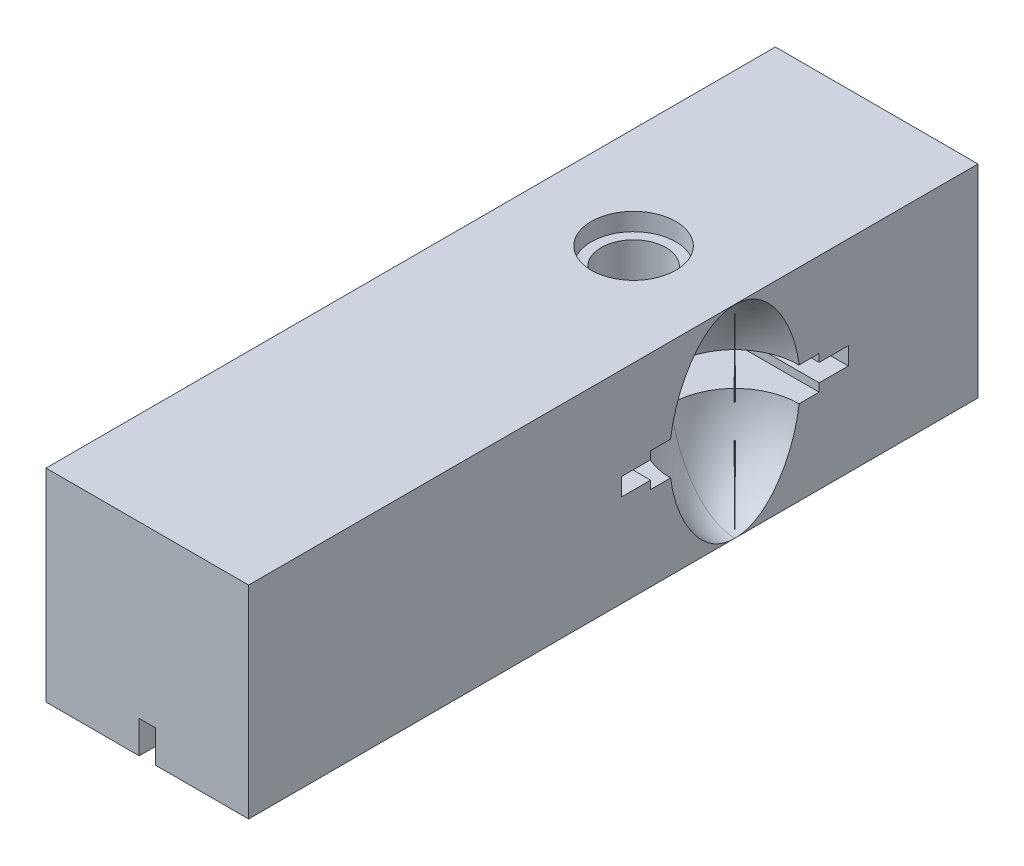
from build123d import *

# Parameters (mm, degrees)
SKETCH4_W               = 12.5
SKETCH4_H               = 12.5
BOSS_EXTRUDE1_DEPTH     = 45
SKETCH8_R               = 2
CUT_EXTRUDE1_DEPTH      = 13
SKETCH11_R              = 2.61
CUT_EXTRUDE2_DEPTH      = 1.5
CUT_EXTRUDE3_DEPTH      = 3.1
CUT_EXTRUDE3_DEPTH_BACK = 9.5
SKETCH15_W              = 14
SKETCH15_H              = 1.09
CUT_EXTRUDE4_START      = -9.5
SKETCH18_W              = 10.4
SKETCH18_H              = 0.5
CUT_EXTRUDE4_DEPTH      = 12.6
CUT_EXTRUDE6_DEPTH      = 2
SKETCH51_W              = 1.356837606
SKETCH51_H              = 0.11872329
SKETCH51_W_2            = 0.13568376
SKETCH51_H_2            = 0.508814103
SKETCH51_W_3            = 0.773397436
SKETCH51_H_3            = 0.094978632
CUT_EXTRUDE7_DEPTH      = 2


with BuildPart() as part:
    # Sketch4 → Boss-Extrude1 (new body)
    with BuildSketch(Plane.XY):
        with Locations((-3.224885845, 6.678082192)):
            Rectangle(SKETCH4_W, SKETCH4_H)
    extrude(amount=BOSS_EXTRUDE1_DEPTH)

    # Sketch8 → Cut-Extrude1 (cut)
    with BuildSketch(Plane(origin=(0, 0, 0), x_dir=(1, 0, 0), z_dir=(0, 1, 0))):
        with Locations(Location((-3.224885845, -15, 0), (0, 0, 90))):
            Circle(SKETCH8_R)
    extrude(amount=CUT_EXTRUDE1_DEPTH, mode=Mode.SUBTRACT)

    # Sketch11 → Cut-Extrude2 (cut)
    with BuildSketch(Plane(origin=(0, 0, 0), x_dir=(1, 0, 0), z_dir=(0, 1, 0))):
        with Locations(Location((-3.224885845, -15, 0), (0, 0, 270))):
            Circle(SKETCH11_R)
    cut_extrude2 = extrude(amount=CUT_EXTRUDE2_DEPTH, mode=Mode.SUBTRACT)

    # Sketch15 → Cut-Extrude3 (cut, two sides: drawn at the far end of the back side and taken through both)
    with BuildSketch(Plane(origin=(0, 0, 0), x_dir=(0, 0, -1), z_dir=(1, 0, 0)).offset(-CUT_EXTRUDE3_DEPTH_BACK)):
        with Locations((-15, 6.678082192)):
            Rectangle(SKETCH15_W, SKETCH15_H)
    extrude(amount=CUT_EXTRUDE3_DEPTH + CUT_EXTRUDE3_DEPTH_BACK, mode=Mode.SUBTRACT)

    # Sketch18 → Cut-Extrude4 (cut)
    with BuildSketch(Plane(origin=(0, 0, 0), x_dir=(0, 0, -1), z_dir=(1, 0, 0)).offset(CUT_EXTRUDE4_START)):
        with Locations((-15, 5.883082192)):
            Rectangle(SKETCH18_W, SKETCH18_H)
    cut_extrude4 = extrude(amount=CUT_EXTRUDE4_DEPTH, mode=Mode.SUBTRACT)

    # Mirror1: Cut-Extrude2 across plane
    add(cut_extrude2.mirror(Plane.ZX.offset(6.668830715)), mode=Mode.SUBTRACT)

    # Sketch20 → Cut-Extrude6 (cut)
    with BuildSketch(Plane.XZ.offset(-0.428082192)):
        Polygon((-3.224885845, 45), (-3.724885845, 45), (-3.724885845, 39.589672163), (-4.724885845, 39.589672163), (-3.224885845, 36.287387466), (-1.724885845, 39.589672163), (-2.724885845, 39.589672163), (-2.724885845, 45), align=None)
    extrude(amount=-CUT_EXTRUDE6_DEPTH, mode=Mode.SUBTRACT)

    # Cut-Sweep1: sweep along a path in Sketch32
    with BuildLine(Plane(origin=(0, 6.668830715, 0), x_dir=(1, 0, 0), z_dir=(0, 1, 0))) as cut_sweep1_path:
        ThreePointArc((-0.974885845, -15), (0.196687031, -17.828427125), (3.025114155, -19))
    # Sketch49 → Cut-Sweep1 (sweep, cut)
    with BuildSketch(Plane.XY.offset(15)):
        with BuildLine():
            Line((3.023006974, 0.429689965), (2.982269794, 6.668830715))
            Line((2.982269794, 6.668830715), (-0.974885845, 6.668830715))
            add(Edge.make_bspline(
                [(-0.974885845, 6.668830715), (-1.12334203, 4.301959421), (0.493528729, 0.427729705), (3.013566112, 0.429628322), (3.023006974, 0.429689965)],
                knots=[0, 0, 0, 0, 0.99625868, 1, 1, 1, 1], degree=3))
        make_face()
    cut_sweep1 = sweep(path=cut_sweep1_path.line, mode=Mode.SUBTRACT)

    # Mirror2: Cut-Sweep1 across plane
    add(cut_sweep1.mirror(Plane(origin=(0.021903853, 2.652171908, 15), x_dir=(1, 0, 0), z_dir=(0, 0, -1))), mode=Mode.SUBTRACT)

    # Mirror11: Cut-Sweep1 across plane
    add(cut_sweep1.mirror(Plane.ZX.offset(6.668830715)), mode=Mode.SUBTRACT)

    # Mirror12 copy 1: sweep along a path in Mirror12 copy 1 path
    with BuildLine(Plane(origin=(0, 6.668830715, 30), x_dir=(1, 0, 0), z_dir=(0, -1, 0))) as mirror12_copy_1_path:
        ThreePointArc((-0.974885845, -15), (0.196687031, -17.828427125), (3.025114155, -19))
    # Mirror12 copy 1 sketch → Mirror12 copy 1 (sweep, cut)
    with BuildSketch(Plane(origin=(0, 13.337661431, 15), x_dir=(1, 0, 0), z_dir=(0, 0, -1))):
        with BuildLine():
            Line((3.023006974, 0.429689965), (2.982269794, 6.668830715))
            Line((2.982269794, 6.668830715), (-0.974885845, 6.668830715))
            add(Edge.make_bspline(
                [(-0.974885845, 6.668830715), (-1.12334203, 4.301959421), (0.493528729, 0.427729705), (3.013566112, 0.429628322), (3.023006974, 0.429689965)],
                knots=[0, 0, 0, 0, 0.99625868, 1, 1, 1, 1], degree=3))
        make_face()
    sweep(path=mirror12_copy_1_path.line, mode=Mode.SUBTRACT)

    # Mirror12 copy 2: sweep along a path in Mirror12 copy 2 path
    with BuildLine(Plane(origin=(0, 6.668830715, 30), x_dir=(1, 0, 0), z_dir=(0, 1, 0))) as mirror12_copy_2_path:
        ThreePointArc((-0.974885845, 15), (0.196687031, 17.828427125), (3.025114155, 19))
    # Mirror12 copy 2 sketch → Mirror12 copy 2 (sweep, cut)
    with BuildSketch(Plane(origin=(0, 0, 15), x_dir=(1, 0, 0), z_dir=(0, 0, -1))):
        with BuildLine():
            Line((3.023006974, -0.429689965), (2.982269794, -6.668830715))
            Line((2.982269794, -6.668830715), (-0.974885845, -6.668830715))
            add(Edge.make_bspline(
                [(-0.974885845, -6.668830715), (-1.12334203, -4.301959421), (0.493528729, -0.427729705), (3.013566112, -0.429628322), (3.023006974, -0.429689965)],
                knots=[0, 0, 0, 0, 0.99625868, 1, 1, 1, 1], degree=3))
        make_face()
    sweep(path=mirror12_copy_2_path.line, mode=Mode.SUBTRACT)

    # Mirror15: Cut-Sweep1 across plane
    add(cut_sweep1.mirror(Plane(origin=(-3.225, 0, 0), x_dir=(0, 0, 1), z_dir=(1, 0, 0))), mode=Mode.SUBTRACT)

    # Mirror15 copy 1: sweep along a path in Mirror15 copy 1 path
    with BuildLine(Plane(origin=(-6.45, 6.668830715, 0), x_dir=(-1, 0, 0), z_dir=(0, -1, 0))) as mirror15_copy_1_path:
        ThreePointArc((-0.974885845, -15), (0.196687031, -17.828427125), (3.025114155, -19))
    # Mirror15 copy 1 sketch → Mirror15 copy 1 (sweep, cut)
    with BuildSketch(Plane(origin=(-6.45, 13.337661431, 15), x_dir=(-1, 0, 0), z_dir=(0, 0, 1))):
        with BuildLine():
            Line((3.023006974, 0.429689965), (2.982269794, 6.668830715))
            Line((2.982269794, 6.668830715), (-0.974885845, 6.668830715))
            add(Edge.make_bspline(
                [(-0.974885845, 6.668830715), (-1.12334203, 4.301959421), (0.493528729, 0.427729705), (3.013566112, 0.429628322), (3.023006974, 0.429689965)],
                knots=[0, 0, 0, 0, 0.99625868, 1, 1, 1, 1], degree=3))
        make_face()
    sweep(path=mirror15_copy_1_path.line, mode=Mode.SUBTRACT)

    # Mirror16 copy 1: sweep along a path in Mirror16 copy 1 path
    with BuildLine(Plane(origin=(-6.45, 6.668830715, 30), x_dir=(-1, 0, 0), z_dir=(0, 1, 0))) as mirror16_copy_1_path:
        ThreePointArc((-0.974885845, -15), (0.196687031, -17.828427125), (3.025114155, -19))
    # Mirror16 copy 1 sketch → Mirror16 copy 1 (sweep, cut)
    with BuildSketch(Plane(origin=(-6.45, 0, 15), x_dir=(-1, 0, 0), z_dir=(0, 0, -1))):
        with BuildLine():
            Line((3.023006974, 0.429689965), (2.982269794, 6.668830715))
            Line((2.982269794, 6.668830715), (-0.974885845, 6.668830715))
            add(Edge.make_bspline(
                [(-0.974885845, 6.668830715), (-1.12334203, 4.301959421), (0.493528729, 0.427729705), (3.013566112, 0.429628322), (3.023006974, 0.429689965)],
                knots=[0, 0, 0, 0, 0.99625868, 1, 1, 1, 1], degree=3))
        make_face()
    sweep(path=mirror16_copy_1_path.line, mode=Mode.SUBTRACT)

    # Mirror16 copy 2: sweep along a path in Mirror16 copy 2 path
    with BuildLine(Plane(origin=(-6.45, 6.668830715, 30), x_dir=(-1, 0, 0), z_dir=(0, -1, 0))) as mirror16_copy_2_path:
        ThreePointArc((-0.974885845, 15), (0.196687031, 17.828427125), (3.025114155, 19))
    # Mirror16 copy 2 sketch → Mirror16 copy 2 (sweep, cut)
    with BuildSketch(Plane(origin=(-6.45, 13.337661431, 15), x_dir=(-1, 0, 0), z_dir=(0, 0, -1))):
        with BuildLine():
            Line((3.023006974, -0.429689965), (2.982269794, -6.668830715))
            Line((2.982269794, -6.668830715), (-0.974885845, -6.668830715))
            add(Edge.make_bspline(
                [(-0.974885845, -6.668830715), (-1.12334203, -4.301959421), (0.493528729, -0.427729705), (3.013566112, -0.429628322), (3.023006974, -0.429689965)],
                knots=[0, 0, 0, 0, 0.99625868, 1, 1, 1, 1], degree=3))
        make_face()
    sweep(path=mirror16_copy_2_path.line, mode=Mode.SUBTRACT)

    # Mirror16 copy 3: sweep along a path in Mirror16 copy 3 path
    with BuildLine(Plane(origin=(0, 6.668830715, 30), x_dir=(1, 0, 0), z_dir=(0, 1, 0))) as mirror16_copy_3_path:
        ThreePointArc((-0.974885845, 15), (0.196687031, 17.828427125), (3.025114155, 19))
    # Mirror16 copy 3 sketch → Mirror16 copy 3 (sweep, cut)
    with BuildSketch(Plane(origin=(0, 0, 15), x_dir=(1, 0, 0), z_dir=(0, 0, -1))):
        with BuildLine():
            Line((3.023006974, -0.429689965), (2.982269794, -6.668830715))
            Line((2.982269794, -6.668830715), (-0.974885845, -6.668830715))
            add(Edge.make_bspline(
                [(-0.974885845, -6.668830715), (-1.12334203, -4.301959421), (0.493528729, -0.427729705), (3.013566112, -0.429628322), (3.023006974, -0.429689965)],
                knots=[0, 0, 0, 0, 0.99625868, 1, 1, 1, 1], degree=3))
        make_face()
    sweep(path=mirror16_copy_3_path.line, mode=Mode.SUBTRACT)

    # Mirror17: Cut-Extrude4 across plane
    add(cut_extrude4.mirror(Plane.ZX.offset(6.668830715)), mode=Mode.SUBTRACT)

    # Sketch51 → Cut-Extrude7 (cut)
    # profile 1 of 20: a face of its own
    with BuildSketch(Plane(origin=(0, 0.428118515, 0), x_dir=(1, 0, 0), z_dir=(0, 1, 0))):
        Polygon((-7.136479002, -43.773451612), (-5.813562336, -43.598811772), (-5.813562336, -43.581851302), (-6.899032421, -43.035671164), (-5.813562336, -42.490816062), (-5.813562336, -42.473590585), (-7.136479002, -42.297890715), (-7.136479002, -42.41714402), (-6.184572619, -42.543817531), (-7.136479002, -43.021360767), (-7.136479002, -43.048126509), (-6.18245256, -43.527524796), (-7.136479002, -43.6539333), align=None)
    # profile 2 of 20: a face of its own
    with BuildSketch(Plane(origin=(0, 0.428118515, 0), x_dir=(1, 0, 0), z_dir=(0, 1, 0))):
        with BuildLine():
            add(Edge.make_bspline(
                [(-6.152771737, -41.593501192), (-6.153156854, -41.575361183), (-6.153911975, -41.539793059), (-6.162022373, -41.487711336), (-6.174321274, -41.438047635), (-6.191633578, -41.390588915), (-6.214347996, -41.345727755), (-6.241816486, -41.303063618), (-6.274224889, -41.262681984), (-6.299308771, -41.238483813), (-6.312041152, -41.226201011)],
                knots=[0, 0, 0, 0, 1.054042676, 2.066720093, 3.05716247, 4.025731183, 4.997454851, 5.974904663, 6.97207755, 8, 8, 8, 8], degree=3))
            add(Edge.make_bspline(
                [(-6.312041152, -41.226201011), (-6.324217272, -41.215624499), (-6.348333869, -41.194676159), (-6.387437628, -41.167815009), (-6.427934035, -41.144674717), (-6.470360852, -41.126130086), (-6.514347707, -41.111508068), (-6.560045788, -41.101126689), (-6.607354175, -41.094951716), (-6.639483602, -41.094119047), (-6.655755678, -41.093697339)],
                knots=[0, 0, 0, 0, 1.025258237, 2.030674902, 3.01204498, 3.988269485, 4.97094183, 5.956517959, 6.965070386, 8, 8, 8, 8], degree=3))
            add(Edge.make_bspline(
                [(-6.655755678, -41.093697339), (-6.672122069, -41.094068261), (-6.704462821, -41.09480122), (-6.75209514, -41.101734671), (-6.798281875, -41.112518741), (-6.84282965, -41.127952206), (-6.885874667, -41.147742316), (-6.927228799, -41.171891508), (-6.966974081, -41.200569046), (-7.004771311, -41.233077), (-7.03961199, -41.269002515), (-7.069959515, -41.307984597), (-7.096068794, -41.349285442), (-7.116806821, -41.393468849), (-7.133523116, -41.439905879), (-7.145050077, -41.488891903), (-7.152081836, -41.54038322), (-7.152980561, -41.575546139), (-7.153439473, -41.593501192)],
                knots=[0, 0, 0, 0, 0.998669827, 1.973418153, 2.932281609, 3.89081133, 4.846438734, 5.82045571, 6.809776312, 7.834649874, 8.860672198, 9.859676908, 10.845817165, 11.837296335, 12.833502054, 13.853824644, 14.904110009, 16, 16, 16, 16], degree=3))
            add(Edge.make_bspline(
                [(-7.153439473, -41.593501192), (-7.152976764, -41.61154335), (-7.152070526, -41.646879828), (-7.145102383, -41.698565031), (-7.133399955, -41.747757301), (-7.117013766, -41.79441399), (-7.095898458, -41.838597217), (-7.070061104, -41.880050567), (-7.039596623, -41.919051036), (-7.004775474, -41.954987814), (-6.966973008, -41.987492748), (-6.927229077, -42.016171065), (-6.885874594, -42.040320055), (-6.84282967, -42.060110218), (-6.79828187, -42.075543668), (-6.752095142, -42.086327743), (-6.704462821, -42.093261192), (-6.672122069, -42.093994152), (-6.655755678, -42.094365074)],
                knots=[0, 0, 0, 0, 1.099861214, 2.154133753, 3.1731438, 4.178222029, 5.163564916, 6.153006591, 7.15072618, 8.175428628, 9.198983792, 10.187031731, 11.15979573, 12.114193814, 13.071490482, 14.029120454, 15.002614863, 16, 16, 16, 16], degree=3))
            add(Edge.make_bspline(
                [(-6.655755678, -42.094365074), (-6.639572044, -42.093940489), (-6.607531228, -42.093099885), (-6.560311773, -42.086931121), (-6.514691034, -42.076590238), (-6.470873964, -42.061950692), (-6.42863307, -42.043235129), (-6.388036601, -42.020419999), (-6.349109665, -41.99328485), (-6.325024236, -41.972419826), (-6.312836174, -41.961861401)],
                knots=[0, 0, 0, 0, 1.031353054, 2.041901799, 3.029428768, 4.008703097, 4.981709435, 5.96992636, 6.972712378, 8, 8, 8, 8], degree=3))
            add(Edge.make_bspline(
                [(-6.312836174, -41.961861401), (-6.299995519, -41.949596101), (-6.274742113, -41.92547423), (-6.242397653, -41.884906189), (-6.214558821, -41.842425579), (-6.191855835, -41.797275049), (-6.174352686, -41.749684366), (-6.16196497, -41.699651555), (-6.153947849, -41.647380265), (-6.153167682, -41.611639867), (-6.152771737, -41.593501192)],
                knots=[0, 0, 0, 0, 1.027951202, 2.021646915, 2.998468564, 3.9668038, 4.943370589, 5.93035926, 6.949632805, 8, 8, 8, 8], degree=3))
        make_face()
        with BuildLine():
            add(Edge.make_bspline(
                [(-6.271495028, -41.594031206), (-6.27185964, -41.606858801), (-6.272579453, -41.632182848), (-6.27805374, -41.669458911), (-6.286728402, -41.70534326), (-6.299048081, -41.739908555), (-6.314975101, -41.773021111), (-6.334427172, -41.804717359), (-6.357507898, -41.834912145), (-6.383758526, -41.863373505), (-6.412271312, -41.889800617), (-6.442931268, -41.912635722), (-6.474858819, -41.932088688), (-6.508219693, -41.948277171), (-6.543329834, -41.960338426), (-6.579797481, -41.969096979), (-6.61769535, -41.974566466), (-6.643458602, -41.975279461), (-6.6565507, -41.975641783)],
                knots=[0, 0, 0, 0, 1.021589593, 2.016807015, 2.994807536, 3.958602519, 4.934347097, 5.916793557, 6.916107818, 7.957073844, 8.998039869, 10.008589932, 10.997041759, 11.972786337, 12.956492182, 13.948170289, 14.957322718, 16, 16, 16, 16], degree=3))
            add(Edge.make_bspline(
                [(-6.6565507, -41.975641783), (-6.673466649, -41.975036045), (-6.707041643, -41.973833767), (-6.756474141, -41.964007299), (-6.804019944, -41.947685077), (-6.849106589, -41.925177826), (-6.890894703, -41.897459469), (-6.928470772, -41.865048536), (-6.960385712, -41.827496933), (-6.987226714, -41.786083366), (-7.008363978, -41.741394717), (-7.023522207, -41.694180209), (-7.033243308, -41.644869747), (-7.034220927, -41.611125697), (-7.034716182, -41.594031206)],
                knots=[0, 0, 0, 0, 1.016977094, 2.018509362, 3.018404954, 4.033172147, 5.041280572, 6.028085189, 7.007940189, 7.995502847, 8.989109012, 9.972200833, 10.97273166, 12, 12, 12, 12], degree=3))
            add(Edge.make_bspline(
                [(-7.034716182, -41.594031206), (-7.034223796, -41.576935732), (-7.03325184, -41.543189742), (-7.023472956, -41.49381067), (-7.008429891, -41.446466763), (-6.98720284, -41.401731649), (-6.960487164, -41.360299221), (-6.928288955, -41.323015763), (-6.890993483, -41.290325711), (-6.849161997, -41.262579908), (-6.803949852, -41.240435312), (-6.756482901, -41.224036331), (-6.707039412, -41.214233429), (-6.673465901, -41.213027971), (-6.6565507, -41.212420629)],
                knots=[0, 0, 0, 0, 1.027082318, 2.027431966, 3.015401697, 4.008827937, 4.996211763, 5.971861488, 6.96198607, 7.969911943, 8.982141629, 9.981856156, 10.983207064, 12, 12, 12, 12], degree=3))
            add(Edge.make_bspline(
                [(-6.6565507, -41.212420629), (-6.643457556, -41.212780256), (-6.617692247, -41.213487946), (-6.579809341, -41.218996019), (-6.543257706, -41.227618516), (-6.508361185, -41.240207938), (-6.474695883, -41.255840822), (-6.443027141, -41.275767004), (-6.412251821, -41.298495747), (-6.383775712, -41.324971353), (-6.357411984, -41.353429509), (-6.33451125, -41.383851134), (-6.314963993, -41.415562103), (-6.299046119, -41.448685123), (-6.28677582, -41.483172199), (-6.278015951, -41.518947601), (-6.272599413, -41.556058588), (-6.271865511, -41.581292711), (-6.271495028, -41.594031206)],
                knots=[0, 0, 0, 0, 1.043020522, 2.052505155, 3.044509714, 4.030878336, 5.003918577, 5.996372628, 7.007255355, 8.048564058, 9.08987276, 10.095126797, 11.077896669, 12.053962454, 13.01807471, 13.98956039, 14.985105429, 16, 16, 16, 16], degree=3))
        make_face(mode=Mode.SUBTRACT)
    # profile 3 of 20: a face of its own
    with BuildSketch(Plane(origin=(0, 0.428118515, 0), x_dir=(1, 0, 0), z_dir=(0, 1, 0))):
        with BuildLine():
            Line((-5.779641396, -39.872543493), (-7.136479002, -39.872543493))
            Line((-7.136479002, -39.872543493), (-7.136479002, -39.991266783))
            Line((-7.136479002, -39.991266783), (-6.969259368, -39.991266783))
            add(Edge.make_bspline(
                [(-6.969259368, -39.991266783), (-6.984397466, -40.004651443), (-7.013939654, -40.030771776), (-7.052419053, -40.074390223), (-7.084486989, -40.120433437), (-7.110146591, -40.169057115), (-7.129567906, -40.220115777), (-7.143225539, -40.273463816), (-7.152116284, -40.329030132), (-7.152994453, -40.366924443), (-7.153439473, -40.386127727)],
                knots=[0, 0, 0, 0, 1.074295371, 2.096500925, 3.086030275, 4.053105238, 5.014108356, 5.985331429, 6.979048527, 8, 8, 8, 8], degree=3))
            add(Edge.make_bspline(
                [(-7.153439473, -40.386127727), (-7.15297601, -40.403200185), (-7.152062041, -40.436867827), (-7.144969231, -40.486393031), (-7.133584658, -40.534055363), (-7.117732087, -40.579885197), (-7.096812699, -40.623572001), (-7.071497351, -40.665361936), (-7.041646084, -40.705352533), (-7.007386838, -40.742783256), (-6.97021578, -40.77729531), (-6.930454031, -40.807489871), (-6.888647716, -40.833080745), (-6.844808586, -40.854111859), (-6.798968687, -40.870386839), (-6.751159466, -40.881709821), (-6.701460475, -40.888794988), (-6.667616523, -40.889708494), (-6.650455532, -40.890171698)],
                knots=[0, 0, 0, 0, 1.034036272, 2.039165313, 3.024406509, 3.999331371, 4.971254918, 5.953351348, 6.95522652, 7.989525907, 9.023492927, 10.024309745, 11.009187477, 11.988246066, 12.964946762, 13.950187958, 14.960617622, 16, 16, 16, 16], degree=3))
            add(Edge.make_bspline(
                [(-6.650455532, -40.890171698), (-6.633649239, -40.88969822), (-6.600424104, -40.888762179), (-6.55156087, -40.881785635), (-6.50449211, -40.870062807), (-6.459392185, -40.853579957), (-6.416079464, -40.832537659), (-6.374892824, -40.80650668), (-6.335202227, -40.776322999), (-6.29828048, -40.741442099), (-6.264299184, -40.703675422), (-6.234375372, -40.663461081), (-6.20912493, -40.621300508), (-6.188598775, -40.577109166), (-6.172287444, -40.531199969), (-6.160916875, -40.483224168), (-6.1542328, -40.433399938), (-6.153263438, -40.399575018), (-6.152771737, -40.382417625)],
                knots=[0, 0, 0, 0, 1.02050356, 2.017480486, 2.990790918, 3.96161403, 4.928589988, 5.909588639, 6.91611943, 7.952353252, 8.989586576, 9.99823133, 10.991940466, 11.968822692, 12.952985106, 13.945868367, 14.958059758, 16, 16, 16, 16], degree=3))
            add(Edge.make_bspline(
                [(-6.152771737, -40.382417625), (-6.153361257, -40.362680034), (-6.154518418, -40.323937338), (-6.164289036, -40.267208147), (-6.180496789, -40.213492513), (-6.202911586, -40.16260106), (-6.231835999, -40.114836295), (-6.267076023, -40.07000206), (-6.309045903, -40.028433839), (-6.3406574, -40.003844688), (-6.356827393, -39.991266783)],
                knots=[0, 0, 0, 0, 1.030970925, 2.023681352, 2.997808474, 3.956843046, 4.921958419, 5.908293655, 6.930045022, 8, 8, 8, 8], degree=3))
            Line((-6.356827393, -39.991266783), (-5.779641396, -39.991266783))
            Line((-5.779641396, -39.991266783), (-5.779641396, -39.872543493))
        make_face()
        with BuildLine():
            add(Edge.make_bspline(
                [(-6.271495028, -40.380827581), (-6.272112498, -40.398182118), (-6.273331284, -40.432437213), (-6.282846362, -40.482724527), (-6.29867738, -40.530846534), (-6.320329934, -40.576559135), (-6.347550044, -40.619152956), (-6.380498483, -40.657183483), (-6.418127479, -40.691105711), (-6.460753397, -40.719152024), (-6.505929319, -40.742797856), (-6.553511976, -40.759013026), (-6.602181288, -40.769803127), (-6.635204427, -40.770898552), (-6.651780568, -40.771448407)],
                knots=[0, 0, 0, 0, 1.031093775, 2.03521511, 3.029845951, 4.035119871, 5.034286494, 6.024708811, 7.017619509, 8.03559408, 9.050082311, 10.039808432, 11.016071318, 12, 12, 12, 12], degree=3))
            add(Edge.make_bspline(
                [(-6.651780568, -40.771448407), (-6.668254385, -40.770737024), (-6.701137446, -40.769317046), (-6.749951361, -40.759297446), (-6.797342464, -40.741936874), (-6.843144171, -40.718830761), (-6.885857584, -40.690155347), (-6.924222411, -40.656514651), (-6.957302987, -40.617999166), (-6.98499144, -40.575312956), (-7.007279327, -40.529791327), (-7.022995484, -40.481897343), (-7.03291939, -40.432472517), (-7.034115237, -40.398805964), (-7.034716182, -40.38188761)],
                knots=[0, 0, 0, 0, 0.979154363, 1.954470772, 2.947816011, 3.971783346, 4.997163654, 5.998045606, 6.995988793, 8.00538986, 9.015323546, 10.000094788, 10.994993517, 12, 12, 12, 12], degree=3))
            add(Edge.make_bspline(
                [(-7.034716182, -40.38188761), (-7.034098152, -40.364707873), (-7.032872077, -40.330625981), (-7.02319787, -40.280220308), (-7.007563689, -40.231228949), (-6.985601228, -40.184380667), (-6.958506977, -40.140770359), (-6.926647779, -40.101679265), (-6.88990619, -40.068299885), (-6.849202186, -40.040317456), (-6.804788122, -40.018212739), (-6.75729927, -40.002621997), (-6.707108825, -39.993046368), (-6.67275918, -39.99186818), (-6.655225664, -39.991266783)],
                knots=[0, 0, 0, 0, 1.017484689, 2.018529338, 3.030031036, 4.058138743, 5.076350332, 6.065651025, 7.036469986, 8.00785331, 8.984076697, 9.96571663, 10.961615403, 12, 12, 12, 12], degree=3))
            add(Edge.make_bspline(
                [(-6.655225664, -39.991266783), (-6.64186881, -39.991629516), (-6.615578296, -39.99234349), (-6.576976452, -39.997797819), (-6.5400357, -40.006474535), (-6.504715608, -40.018699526), (-6.471217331, -40.034764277), (-6.43927829, -40.054119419), (-6.409195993, -40.077161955), (-6.381008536, -40.10319064), (-6.355427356, -40.132002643), (-6.332880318, -40.162640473), (-6.31379932, -40.195027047), (-6.29852953, -40.229139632), (-6.286089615, -40.264715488), (-6.277873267, -40.302095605), (-6.272213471, -40.340903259), (-6.27173703, -40.367379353), (-6.271495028, -40.380827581)],
                knots=[0, 0, 0, 0, 1.050062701, 2.066855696, 3.059271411, 4.030305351, 4.999747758, 5.975466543, 6.961907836, 7.974539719, 8.98812422, 9.98710676, 10.961662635, 11.93785114, 12.922015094, 13.919620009, 14.94329489, 16, 16, 16, 16], degree=3))
        make_face(mode=Mode.SUBTRACT)
    # profile 4 of 20: a face of its own
    with BuildSketch(Plane(origin=(0, 0.428118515, 0), x_dir=(1, 0, 0), z_dir=(0, 1, 0))):
        with BuildLine():
            Line((-6.831190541, -38.80774398), (-6.886577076, -38.702271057))
            add(Edge.make_bspline(
                [(-6.886577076, -38.702271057), (-6.901484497, -38.710677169), (-6.930488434, -38.727032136), (-6.970355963, -38.755137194), (-7.006097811, -38.784634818), (-7.037160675, -38.816542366), (-7.064092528, -38.850466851), (-7.087500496, -38.886458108), (-7.107667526, -38.924395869), (-7.124568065, -38.964413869), (-7.137578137, -39.006857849), (-7.146763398, -39.051845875), (-7.15244216, -39.099459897), (-7.153101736, -39.132096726), (-7.153439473, -39.148808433)],
                knots=[0, 0, 0, 0, 1.120373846, 2.179803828, 3.190307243, 4.151866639, 5.090753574, 6.023181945, 6.960194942, 7.901556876, 8.864247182, 9.862852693, 10.905672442, 12, 12, 12, 12], degree=3))
            add(Edge.make_bspline(
                [(-7.153439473, -39.148808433), (-7.153005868, -39.167382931), (-7.15216003, -39.203616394), (-7.144867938, -39.256359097), (-7.132972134, -39.306017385), (-7.116354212, -39.35258849), (-7.09464803, -39.395958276), (-7.068205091, -39.436213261), (-7.037160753, -39.473563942), (-7.001247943, -39.506837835), (-6.96281034, -39.536779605), (-6.92277688, -39.563247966), (-6.881127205, -39.58522176), (-6.838509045, -39.60370069), (-6.79453019, -39.617701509), (-6.749431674, -39.627950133), (-6.70299003, -39.633745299), (-6.671582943, -39.634644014), (-6.655755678, -39.635096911)],
                knots=[0, 0, 0, 0, 1.145226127, 2.234004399, 3.276654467, 4.290038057, 5.276870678, 6.260645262, 7.254731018, 8.264593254, 9.273837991, 10.257612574, 11.220387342, 12.174754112, 13.118989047, 14.062768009, 15.023752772, 16, 16, 16, 16], degree=3))
            add(Edge.make_bspline(
                [(-6.655755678, -39.635096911), (-6.640903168, -39.634696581), (-6.611467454, -39.63390318), (-6.567899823, -39.628902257), (-6.525555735, -39.620039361), (-6.484400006, -39.607877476), (-6.444501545, -39.592172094), (-6.405836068, -39.572958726), (-6.368444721, -39.55020744), (-6.344857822, -39.532641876), (-6.332976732, -39.523793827)],
                knots=[0, 0, 0, 0, 1.024358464, 2.0301432, 3.019427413, 4.004406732, 4.986367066, 5.972626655, 6.978780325, 8, 8, 8, 8], degree=3))
            add(Edge.make_bspline(
                [(-6.332976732, -39.523793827), (-6.318663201, -39.511809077), (-6.290489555, -39.488219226), (-6.253471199, -39.448321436), (-6.222460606, -39.405118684), (-6.196755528, -39.359152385), (-6.177224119, -39.309888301), (-6.16266917, -39.257988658), (-6.154513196, -39.202862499), (-6.153361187, -39.165176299), (-6.152771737, -39.145893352)],
                knots=[0, 0, 0, 0, 1.030682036, 2.02871468, 2.997146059, 3.962720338, 4.930598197, 5.918074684, 6.934738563, 8, 8, 8, 8], degree=3))
            add(Edge.make_bspline(
                [(-6.152771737, -39.145893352), (-6.153283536, -39.126069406), (-6.154287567, -39.087179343), (-6.163595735, -39.030470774), (-6.178356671, -38.976813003), (-6.19920349, -38.926227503), (-6.226100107, -38.878709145), (-6.259415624, -38.834566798), (-6.298127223, -38.793045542), (-6.32789784, -38.768889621), (-6.343047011, -38.756597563)],
                knots=[0, 0, 0, 0, 1.056321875, 2.072262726, 3.055038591, 4.01806755, 4.982017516, 5.957941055, 6.960871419, 8, 8, 8, 8], degree=3))
            add(Edge.make_bspline(
                [(-6.343047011, -38.756597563), (-6.354463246, -38.748234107), (-6.377219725, -38.731562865), (-6.414326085, -38.710680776), (-6.453148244, -38.692554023), (-6.494313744, -38.678065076), (-6.537334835, -38.666332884), (-6.582519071, -38.657844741), (-6.629852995, -38.652866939), (-6.662104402, -38.651888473), (-6.67854631, -38.651389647)],
                knots=[0, 0, 0, 0, 0.94817472, 1.890038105, 2.849395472, 3.817997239, 4.812318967, 5.836947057, 6.897266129, 8, 8, 8, 8], degree=3))
            Line((-6.67854631, -38.651389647), (-6.67854631, -39.516373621))
            add(Edge.make_bspline(
                [(-6.67854631, -39.516373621), (-6.691284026, -39.515791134), (-6.716332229, -39.514645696), (-6.752988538, -39.509318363), (-6.787890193, -39.500880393), (-6.820888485, -39.48915137), (-6.852091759, -39.474444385), (-6.881715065, -39.456994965), (-6.909308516, -39.436050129), (-6.935229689, -39.412727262), (-6.958304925, -39.38675406), (-6.978974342, -39.359439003), (-6.99620236, -39.330423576), (-7.010396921, -39.300000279), (-7.021322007, -39.268011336), (-7.028845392, -39.23450173), (-7.033871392, -39.199575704), (-7.03443119, -39.175768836), (-7.034716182, -39.163648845)],
                knots=[0, 0, 0, 0, 1.094405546, 2.152104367, 3.174987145, 4.173015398, 5.153654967, 6.133208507, 7.119289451, 8.123438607, 9.122504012, 10.097966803, 11.060604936, 12.014205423, 12.976096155, 13.956823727, 14.959826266, 16, 16, 16, 16], degree=3))
            add(Edge.make_bspline(
                [(-7.034716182, -39.163648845), (-7.034487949, -39.151798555), (-7.034035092, -39.128285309), (-7.029566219, -39.093187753), (-7.022458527, -39.058639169), (-7.012689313, -39.024887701), (-7.000654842, -38.992667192), (-6.986229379, -38.962742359), (-6.970454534, -38.935012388), (-6.952128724, -38.909244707), (-6.929929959, -38.884251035), (-6.901910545, -38.859769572), (-6.869112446, -38.833164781), (-6.844326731, -38.816549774), (-6.831190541, -38.80774398)],
                knots=[0, 0, 0, 0, 0.990963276, 1.966261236, 2.95471375, 3.93937425, 4.902926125, 5.828461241, 6.715766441, 7.568835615, 8.469155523, 9.505141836, 10.677749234, 12, 12, 12, 12], degree=3))
        make_face()
        with BuildLine():
            add(Edge.make_bspline(
                [(-6.55982302, -38.770112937), (-6.54407164, -38.774450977), (-6.513755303, -38.782800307), (-6.471873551, -38.800358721), (-6.434435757, -38.819683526), (-6.402060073, -38.843008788), (-6.373506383, -38.869665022), (-6.348301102, -38.90012932), (-6.325860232, -38.934329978), (-6.3068988, -38.972031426), (-6.290764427, -39.011962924), (-6.279944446, -39.053769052), (-6.272532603, -39.096426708), (-6.271842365, -39.125279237), (-6.271495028, -39.139798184)],
                knots=[0, 0, 0, 0, 1.154756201, 2.222533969, 3.206705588, 4.129403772, 5.035894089, 5.963342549, 6.920206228, 7.923656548, 8.944970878, 9.96070521, 10.973801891, 12, 12, 12, 12], degree=3))
            add(Edge.make_bspline(
                [(-6.271495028, -39.139798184), (-6.271727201, -39.151647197), (-6.272186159, -39.175070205), (-6.276507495, -39.209584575), (-6.283743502, -39.242790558), (-6.293379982, -39.274870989), (-6.3066571, -39.305267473), (-6.321909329, -39.334771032), (-6.340648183, -39.362652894), (-6.354918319, -39.380093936), (-6.36212754, -39.388905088)],
                knots=[0, 0, 0, 0, 1.048700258, 2.073059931, 3.073189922, 4.055269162, 5.032885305, 6.005420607, 6.992345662, 8, 8, 8, 8], degree=3))
            add(Edge.make_bspline(
                [(-6.36212754, -39.388905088), (-6.367832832, -39.395214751), (-6.379378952, -39.407983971), (-6.399271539, -39.425046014), (-6.420722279, -39.441382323), (-6.444551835, -39.456249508), (-6.470488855, -39.469885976), (-6.498314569, -39.482646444), (-6.528240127, -39.494131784), (-6.549093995, -39.500593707), (-6.55982302, -39.503918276)],
                knots=[0, 0, 0, 0, 0.879870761, 1.780643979, 2.707998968, 3.669668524, 4.684282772, 5.740141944, 6.837334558, 8, 8, 8, 8], degree=3))
            Line((-6.55982302, -39.503918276), (-6.55982302, -38.770112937))
        make_face(mode=Mode.SUBTRACT)
    # profile 5 of 20: a face of its own
    with BuildSketch(Plane(origin=(0, 0.428118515, 0), x_dir=(1, 0, 0), z_dir=(0, 1, 0))):
        with Locations((-6.458060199, -38.37154189)):
            Rectangle(SKETCH51_W, SKETCH51_H)
    # profile 6 of 20: a face of its own
    with BuildSketch(Plane(origin=(0, 0.428118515, 0), x_dir=(1, 0, 0), z_dir=(0, 1, 0))):
        Polygon((-5.813562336, -36.955342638), (-7.136479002, -36.344765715), (-7.136479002, -36.473824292), (-6.71246725, -36.669399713), (-6.71246725, -37.269111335), (-7.136479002, -37.470251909), (-7.136479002, -37.599840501), (-5.813562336, -36.972303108), align=None)
        Polygon((-6.071414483, -36.96514791), (-6.57678349, -37.20471455), (-6.57678349, -36.731941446), align=None, mode=Mode.SUBTRACT)
    # profile 7 of 20: a face of its own
    with BuildSketch(Plane(origin=(0, 0.428118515, 0), x_dir=(1, 0, 0), z_dir=(0, 1, 0))):
        with Locations((-6.6276649, -35.496742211)):
            Rectangle(SKETCH51_W_2, SKETCH51_H_2)
    # profile 8 of 20: a face of its own
    with BuildSketch(Plane(origin=(0, 0.428118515, 0), x_dir=(1, 0, 0), z_dir=(0, 1, 0))):
        Polygon((-5.813562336, -34.614797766), (-5.813562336, -34.487594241), (-6.856101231, -34.046622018), (-5.813562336, -33.605649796), (-5.813562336, -33.47844627), (-7.136479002, -34.038141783), (-7.136479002, -34.055102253), align=None)
    # profile 9 of 20: a face of its own
    with BuildSketch(Plane(origin=(0, 0.428118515, 0), x_dir=(1, 0, 0), z_dir=(0, 1, 0))):
        with BuildLine():
            Line((-5.779641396, -32.732185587), (-5.851458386, -32.640758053))
            Line((-5.851458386, -32.640758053), (-6.385978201, -32.990302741))
            add(Edge.make_bspline(
                [(-6.385978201, -32.990302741), (-6.382268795, -32.967030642), (-6.37503318, -32.921635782), (-6.373839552, -32.875686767), (-6.373257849, -32.853293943)],
                knots=[0, 0, 0, 0, 1.025318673, 2, 2, 2, 2], degree=3))
            add(Edge.make_bspline(
                [(-6.373257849, -32.853293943), (-6.373619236, -32.839848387), (-6.374330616, -32.813381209), (-6.379805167, -32.774522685), (-6.388432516, -32.737182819), (-6.401008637, -32.701516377), (-6.417073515, -32.667395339), (-6.436327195, -32.634623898), (-6.459763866, -32.603818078), (-6.48594437, -32.574581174), (-6.514941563, -32.548037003), (-6.54570933, -32.524535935), (-6.578215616, -32.504795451), (-6.612443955, -32.488779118), (-6.648341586, -32.476341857), (-6.685862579, -32.467275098), (-6.725032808, -32.46191555), (-6.75167188, -32.46118776), (-6.765203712, -32.460818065)],
                knots=[0, 0, 0, 0, 1.04369286, 2.054478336, 3.041073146, 4.015093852, 4.984733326, 5.965804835, 6.960378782, 7.985147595, 9.009457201, 10.008161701, 10.986880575, 11.956520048, 12.937015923, 13.931873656, 14.949455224, 16, 16, 16, 16], degree=3))
            add(Edge.make_bspline(
                [(-6.765203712, -32.460818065), (-6.783705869, -32.46150845), (-6.820092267, -32.462866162), (-6.873310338, -32.472749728), (-6.923603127, -32.489806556), (-6.971168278, -32.512626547), (-7.01462188, -32.54223369), (-7.053892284, -32.577319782), (-7.088122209, -32.618216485), (-7.117486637, -32.663955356), (-7.140816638, -32.71345902), (-7.158064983, -32.76536523), (-7.168371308, -32.819230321), (-7.169720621, -32.855812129), (-7.170399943, -32.874229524)],
                knots=[0, 0, 0, 0, 1.031881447, 2.029301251, 3.006342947, 3.987068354, 4.962916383, 5.929513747, 6.915671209, 7.928552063, 8.953527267, 9.960179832, 10.973036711, 12, 12, 12, 12], degree=3))
            add(Edge.make_bspline(
                [(-7.170399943, -32.874229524), (-7.169822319, -32.892030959), (-7.168678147, -32.927292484), (-7.158485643, -32.979163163), (-7.14196548, -33.029004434), (-7.119205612, -33.076465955), (-7.090458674, -33.120435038), (-7.055846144, -33.15975956), (-7.016132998, -33.1943027), (-6.971197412, -33.222898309), (-6.923222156, -33.246203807), (-6.872741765, -33.262641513), (-6.820772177, -33.273271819), (-6.785395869, -33.274368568), (-6.767588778, -33.274920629)],
                knots=[0, 0, 0, 0, 1.011913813, 2.004424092, 2.994488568, 3.992479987, 4.990471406, 5.973328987, 6.963763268, 7.974390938, 8.994854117, 9.989689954, 10.988086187, 12, 12, 12, 12], degree=3))
            add(Edge.make_bspline(
                [(-6.767588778, -33.274920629), (-6.753969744, -33.274441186), (-6.726174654, -33.27346269), (-6.683956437, -33.267623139), (-6.640927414, -33.25691269), (-6.604450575, -33.245321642), (-6.574241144, -33.233819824), (-6.550385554, -33.223155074), (-6.525193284, -33.211230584), (-6.499140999, -33.19725342), (-6.471484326, -33.182436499), (-6.443247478, -33.165128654), (-6.413399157, -33.147067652), (-6.393526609, -33.133836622), (-6.383328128, -33.127046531)],
                knots=[0, 0, 0, 0, 1.17367173, 2.395347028, 3.66355231, 4.98980831, 5.690886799, 6.447442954, 7.240630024, 8.091733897, 8.994365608, 9.943299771, 10.944512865, 12, 12, 12, 12], degree=3))
            Line((-6.383328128, -33.127046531), (-5.779641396, -32.732185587))
        make_face()
        with BuildLine():
            add(Edge.make_bspline(
                [(-6.508941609, -32.878204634), (-6.509239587, -32.888282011), (-6.509824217, -32.908053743), (-6.51312621, -32.937025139), (-6.519382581, -32.964370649), (-6.527475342, -32.990402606), (-6.538494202, -33.014849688), (-6.551719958, -33.037990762), (-6.567444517, -33.059596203), (-6.585492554, -33.079286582), (-6.604963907, -33.097367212), (-6.625944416, -33.112919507), (-6.64779309, -33.126349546), (-6.670715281, -33.137265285), (-6.694696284, -33.14576624), (-6.719627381, -33.151915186), (-6.745675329, -33.155337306), (-6.763339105, -33.155906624), (-6.77235891, -33.156197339)],
                knots=[0, 0, 0, 0, 1.129474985, 2.216020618, 3.260639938, 4.268601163, 5.26556745, 6.258792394, 7.250684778, 8.252748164, 9.247500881, 10.223461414, 11.174097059, 12.117127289, 13.062595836, 14.020469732, 14.98917545, 16, 16, 16, 16], degree=3))
            add(Edge.make_bspline(
                [(-6.77235891, -33.156197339), (-6.781297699, -33.155959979), (-6.798825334, -33.155494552), (-6.824660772, -33.151287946), (-6.849500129, -33.144816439), (-6.873361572, -33.135343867), (-6.896114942, -33.123462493), (-6.91792186, -33.108841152), (-6.93879738, -33.091727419), (-6.958215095, -33.071833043), (-6.976025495, -33.050378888), (-6.991883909, -33.027689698), (-7.005200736, -33.003837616), (-7.015728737, -32.978686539), (-7.024351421, -32.952588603), (-7.030423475, -32.925344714), (-7.033855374, -32.896930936), (-7.03442548, -32.877683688), (-7.034716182, -32.867869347)],
                knots=[0, 0, 0, 0, 0.989642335, 1.94054129, 2.892446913, 3.828371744, 4.778262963, 5.730973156, 6.732161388, 7.763274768, 8.805796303, 9.818398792, 10.825975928, 11.825728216, 12.834635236, 13.867465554, 14.912602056, 16, 16, 16, 16], degree=3))
            add(Edge.make_bspline(
                [(-7.034716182, -32.867869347), (-7.034425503, -32.858054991), (-7.033855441, -32.838807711), (-7.030423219, -32.810394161), (-7.024352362, -32.783149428), (-7.015725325, -32.757054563), (-7.005213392, -32.73189215), (-6.991800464, -32.708019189), (-6.976121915, -32.685113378), (-6.958184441, -32.663673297), (-6.9389071, -32.643695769), (-6.917732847, -32.626982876), (-6.89628826, -32.611899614), (-6.873270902, -32.60047457), (-6.849514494, -32.590896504), (-6.824656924, -32.584457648), (-6.798826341, -32.580242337), (-6.78129804, -32.579778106), (-6.77235891, -32.579541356)],
                knots=[0, 0, 0, 0, 1.087205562, 2.132157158, 3.164804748, 4.173533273, 5.173108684, 6.180507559, 7.20098426, 8.243321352, 9.274252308, 10.269075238, 11.227079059, 12.172305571, 13.108064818, 14.05980203, 15.010532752, 16, 16, 16, 16], degree=3))
            add(Edge.make_bspline(
                [(-6.77235891, -32.579541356), (-6.763326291, -32.579746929), (-6.745598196, -32.580150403), (-6.719650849, -32.584802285), (-6.694493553, -32.591085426), (-6.670693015, -32.601239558), (-6.647591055, -32.613333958), (-6.625847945, -32.628741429), (-6.604847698, -32.646406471), (-6.585363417, -32.666864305), (-6.567541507, -32.689120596), (-6.551810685, -32.71278854), (-6.53853418, -32.737548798), (-6.52745682, -32.763377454), (-6.519462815, -32.790570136), (-6.513168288, -32.818687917), (-6.509818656, -32.848090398), (-6.509237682, -32.868038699), (-6.508941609, -32.878204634)],
                knots=[0, 0, 0, 0, 0.978265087, 1.920016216, 2.851775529, 3.783928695, 4.718195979, 5.674835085, 6.667117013, 7.690134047, 8.732874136, 9.755756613, 10.767227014, 11.776017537, 12.797239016, 13.836276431, 14.897336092, 16, 16, 16, 16], degree=3))
        make_face(mode=Mode.SUBTRACT)
    # profile 10 of 20: a face of its own
    with BuildSketch(Plane(origin=(0, 0.428118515, 0), x_dir=(1, 0, 0), z_dir=(0, 1, 0))):
        with BuildLine():
            Line((-7.480409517, -43.739530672), (-7.480409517, -43.531976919))
            add(Edge.make_bspline(
                [(-7.480409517, -43.531976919), (-7.480425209, -43.517701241), (-7.480455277, -43.490348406), (-7.481366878, -43.451125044), (-7.482584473, -43.415501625), (-7.484272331, -43.383554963), (-7.486267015, -43.355186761), (-7.489064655, -43.330525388), (-7.491985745, -43.309376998), (-7.494955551, -43.296705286), (-7.496309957, -43.290926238)],
                knots=[0, 0, 0, 0, 1.415646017, 2.712440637, 3.8905458, 4.950247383, 5.884950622, 6.709939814, 7.411656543, 8, 8, 8, 8], degree=3))
            add(Edge.make_bspline(
                [(-7.496309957, -43.290926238), (-7.498312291, -43.283610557), (-7.502269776, -43.26915158), (-7.510196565, -43.248317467), (-7.51959426, -43.228494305), (-7.530309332, -43.20961962), (-7.542780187, -43.191904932), (-7.556612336, -43.175123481), (-7.571798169, -43.159179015), (-7.588632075, -43.14461316), (-7.606493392, -43.131203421), (-7.625779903, -43.119699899), (-7.646071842, -43.109969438), (-7.667577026, -43.102022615), (-7.69016475, -43.095979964), (-7.713900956, -43.091515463), (-7.738704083, -43.08865902), (-7.75565588, -43.088387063), (-7.764285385, -43.088248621)],
                knots=[0, 0, 0, 0, 0.999487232, 1.975422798, 2.933948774, 3.889618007, 4.832992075, 5.786114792, 6.754729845, 7.731954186, 8.717668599, 9.695514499, 10.68728626, 11.680675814, 12.71351902, 13.766008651, 14.862761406, 16, 16, 16, 16], degree=3))
            add(Edge.make_bspline(
                [(-7.764285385, -43.088248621), (-7.772987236, -43.088376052), (-7.790012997, -43.088625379), (-7.814920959, -43.091617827), (-7.838723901, -43.095648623), (-7.861369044, -43.101846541), (-7.882721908, -43.109964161), (-7.903108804, -43.119486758), (-7.922182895, -43.130972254), (-7.940013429, -43.14416962), (-7.95661714, -43.158850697), (-7.971873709, -43.174953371), (-7.98569383, -43.192412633), (-7.998108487, -43.211172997), (-8.00882979, -43.231417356), (-8.018432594, -43.252838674), (-8.026497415, -43.275623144), (-8.030739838, -43.291390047), (-8.03289683, -43.299406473)],
                knots=[0, 0, 0, 0, 1.121902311, 2.195077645, 3.232258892, 4.234102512, 5.217864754, 6.176164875, 7.132989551, 8.084763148, 9.034132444, 9.988522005, 10.94243251, 11.903244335, 12.886203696, 13.894208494, 14.929344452, 16, 16, 16, 16], degree=3))
            add(Edge.make_bspline(
                [(-8.03289683, -43.299406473), (-8.034306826, -43.306036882), (-8.037396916, -43.320567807), (-8.040846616, -43.344499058), (-8.043791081, -43.372362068), (-8.045998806, -43.404118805), (-8.047888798, -43.439740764), (-8.049391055, -43.479247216), (-8.050216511, -43.522715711), (-8.050259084, -43.553035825), (-8.050281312, -43.568865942)],
                knots=[0, 0, 0, 0, 0.601384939, 1.31797006, 2.144135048, 3.087295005, 4.142315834, 5.309527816, 6.595305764, 8, 8, 8, 8], degree=3))
            Line((-8.050281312, -43.568865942), (-8.050281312, -43.64455204))
            Line((-8.050281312, -43.64455204), (-8.53874285, -43.64455204))
            Line((-8.53874285, -43.64455204), (-8.53874285, -43.739530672))
            Line((-8.53874285, -43.739530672), (-7.480409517, -43.739530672))
        make_face()
        with BuildLine():
            Line((-7.588956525, -43.64455204), (-7.941734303, -43.64455204))
            Line((-7.941734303, -43.64455204), (-7.944066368, -43.459258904))
            add(Edge.make_bspline(
                [(-7.944066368, -43.459258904), (-7.944072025, -43.4502116), (-7.944082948, -43.432745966), (-7.942861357, -43.407447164), (-7.941513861, -43.384035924), (-7.939403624, -43.362461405), (-7.936623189, -43.342888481), (-7.933596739, -43.325065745), (-7.929496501, -43.309254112), (-7.923779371, -43.290725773), (-7.914218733, -43.270149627), (-7.899983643, -43.247913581), (-7.882336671, -43.228763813), (-7.862222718, -43.21230315), (-7.839765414, -43.199546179), (-7.815925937, -43.189951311), (-7.790689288, -43.184362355), (-7.773428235, -43.183608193), (-7.764709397, -43.183227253)],
                knots=[0, 0, 0, 0, 1.160368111, 2.240066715, 3.248291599, 4.168343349, 5.019594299, 5.784185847, 6.485545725, 7.113397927, 8.269509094, 9.383373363, 10.487084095, 11.595623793, 12.704274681, 13.786671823, 14.88201193, 16, 16, 16, 16], degree=3))
            add(Edge.make_bspline(
                [(-7.764709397, -43.183227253), (-7.756201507, -43.183610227), (-7.739288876, -43.184371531), (-7.714490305, -43.189995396), (-7.690903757, -43.199527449), (-7.66872293, -43.212389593), (-7.648691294, -43.228377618), (-7.631442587, -43.247103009), (-7.61738792, -43.268183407), (-7.608379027, -43.287802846), (-7.602869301, -43.305218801), (-7.599015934, -43.320347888), (-7.595938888, -43.337429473), (-7.593447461, -43.356469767), (-7.591314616, -43.377320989), (-7.589867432, -43.40016234), (-7.589020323, -43.424907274), (-7.588978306, -43.442085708), (-7.588956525, -43.450990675)],
                knots=[0, 0, 0, 0, 1.120550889, 2.227516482, 3.330715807, 4.461473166, 5.594337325, 6.694900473, 7.802844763, 8.919519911, 9.52614448, 10.208195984, 10.975273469, 11.811520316, 12.738076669, 13.736566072, 14.826679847, 16, 16, 16, 16], degree=3))
            Line((-7.588956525, -43.450990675), (-7.588956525, -43.64455204))
        make_face(mode=Mode.SUBTRACT)
    # profile 11 of 20: a face of its own
    with BuildSketch(Plane(origin=(0, 0.428118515, 0), x_dir=(1, 0, 0), z_dir=(0, 1, 0))):
        with BuildLine():
            Line((-8.294512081, -42.263545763), (-8.338821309, -42.179167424))
            add(Edge.make_bspline(
                [(-8.338821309, -42.179167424), (-8.350747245, -42.185892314), (-8.373950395, -42.198976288), (-8.405844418, -42.221460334), (-8.434437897, -42.245058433), (-8.459288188, -42.270584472), (-8.480833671, -42.29772406), (-8.499560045, -42.326517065), (-8.515693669, -42.356867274), (-8.5292141, -42.388881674), (-8.539622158, -42.422836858), (-8.546970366, -42.458827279), (-8.551513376, -42.496918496), (-8.552041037, -42.523027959), (-8.552311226, -42.536397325)],
                knots=[0, 0, 0, 0, 1.120373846, 2.179803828, 3.190307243, 4.151866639, 5.090753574, 6.023181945, 6.960194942, 7.901556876, 8.864247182, 9.862852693, 10.905672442, 12, 12, 12, 12], degree=3))
            add(Edge.make_bspline(
                [(-8.552311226, -42.536397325), (-8.551964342, -42.551256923), (-8.551287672, -42.580243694), (-8.545453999, -42.622437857), (-8.535937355, -42.662164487), (-8.522643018, -42.699421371), (-8.505278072, -42.7341172), (-8.484123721, -42.766321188), (-8.45928825, -42.796201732), (-8.430558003, -42.822820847), (-8.39980792, -42.846774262), (-8.367781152, -42.867948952), (-8.334461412, -42.885527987), (-8.300366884, -42.900311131), (-8.2651838, -42.911511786), (-8.229104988, -42.919710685), (-8.191951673, -42.924346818), (-8.166826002, -42.92506579), (-8.154164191, -42.925428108)],
                knots=[0, 0, 0, 0, 1.145226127, 2.234004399, 3.276654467, 4.290038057, 5.276870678, 6.260645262, 7.254731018, 8.264593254, 9.273837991, 10.257612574, 11.220387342, 12.174754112, 13.118989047, 14.062768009, 15.023752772, 16, 16, 16, 16], degree=3))
            add(Edge.make_bspline(
                [(-8.154164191, -42.925428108), (-8.142282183, -42.925107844), (-8.118733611, -42.924473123), (-8.083879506, -42.920472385), (-8.050004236, -42.913382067), (-8.017079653, -42.90365256), (-7.985160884, -42.891088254), (-7.954228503, -42.87571756), (-7.924315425, -42.857516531), (-7.905445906, -42.84346408), (-7.895941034, -42.83638564)],
                knots=[0, 0, 0, 0, 1.024358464, 2.0301432, 3.019427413, 4.004406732, 4.986367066, 5.972626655, 6.978780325, 8, 8, 8, 8], degree=3))
            add(Edge.make_bspline(
                [(-7.895941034, -42.83638564), (-7.884490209, -42.826797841), (-7.861951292, -42.807925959), (-7.832336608, -42.776007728), (-7.807528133, -42.741445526), (-7.78696407, -42.704672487), (-7.771338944, -42.665261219), (-7.759694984, -42.623741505), (-7.753170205, -42.579640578), (-7.752248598, -42.549491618), (-7.751777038, -42.534065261)],
                knots=[0, 0, 0, 0, 1.030682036, 2.02871468, 2.997146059, 3.962720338, 4.930598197, 5.918074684, 6.934738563, 8, 8, 8, 8], degree=3))
            add(Edge.make_bspline(
                [(-7.751777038, -42.534065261), (-7.752186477, -42.518206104), (-7.752989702, -42.487094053), (-7.760436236, -42.441727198), (-7.772244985, -42.398800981), (-7.78892244, -42.358332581), (-7.810439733, -42.320317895), (-7.837092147, -42.285004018), (-7.868061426, -42.251787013), (-7.89187792, -42.232462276), (-7.903997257, -42.222628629)],
                knots=[0, 0, 0, 0, 1.056321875, 2.072262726, 3.055038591, 4.01806755, 4.982017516, 5.957941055, 6.960871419, 8, 8, 8, 8], degree=3))
            add(Edge.make_bspline(
                [(-7.903997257, -42.222628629), (-7.913130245, -42.215937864), (-7.931335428, -42.202600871), (-7.961020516, -42.1858952), (-7.992078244, -42.171393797), (-8.025010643, -42.15980264), (-8.059427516, -42.150416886), (-8.095574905, -42.143626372), (-8.133442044, -42.13964413), (-8.15924317, -42.138861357), (-8.172396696, -42.138462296)],
                knots=[0, 0, 0, 0, 0.94817472, 1.890038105, 2.849395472, 3.817997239, 4.812318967, 5.836947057, 6.897266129, 8, 8, 8, 8], degree=3))
            Line((-8.172396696, -42.138462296), (-8.172396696, -42.830449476))
            add(Edge.make_bspline(
                [(-8.172396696, -42.830449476), (-8.182586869, -42.829983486), (-8.202625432, -42.829067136), (-8.231950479, -42.824805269), (-8.259871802, -42.818054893), (-8.286270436, -42.808671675), (-8.311233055, -42.796906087), (-8.3349317, -42.782946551), (-8.357006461, -42.766190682), (-8.377743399, -42.747532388), (-8.396203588, -42.726753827), (-8.412739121, -42.704901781), (-8.426521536, -42.68168944), (-8.437877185, -42.657350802), (-8.446617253, -42.631759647), (-8.452635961, -42.604951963), (-8.456656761, -42.577011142), (-8.4571046, -42.557965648), (-8.457332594, -42.548269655)],
                knots=[0, 0, 0, 0, 1.094405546, 2.152104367, 3.174987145, 4.173015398, 5.153654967, 6.133208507, 7.119289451, 8.123438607, 9.122504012, 10.097966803, 11.060604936, 12.014205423, 12.976096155, 13.956823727, 14.959826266, 16, 16, 16, 16], degree=3))
            add(Edge.make_bspline(
                [(-8.457332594, -42.548269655), (-8.457150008, -42.538789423), (-8.456787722, -42.519978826), (-8.453212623, -42.491900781), (-8.44752647, -42.464261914), (-8.439711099, -42.43726074), (-8.430083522, -42.411484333), (-8.418543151, -42.387544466), (-8.405923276, -42.365360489), (-8.391262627, -42.344746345), (-8.373503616, -42.324751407), (-8.351088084, -42.305166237), (-8.324849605, -42.283882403), (-8.305021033, -42.270590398), (-8.294512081, -42.263545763)],
                knots=[0, 0, 0, 0, 0.990963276, 1.966261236, 2.95471375, 3.93937425, 4.902926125, 5.828461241, 6.715766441, 7.568835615, 8.469155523, 9.505141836, 10.677749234, 12, 12, 12, 12], degree=3))
        make_face()
        with BuildLine():
            add(Edge.make_bspline(
                [(-8.077418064, -42.233440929), (-8.06481696, -42.23691136), (-8.040563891, -42.243590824), (-8.007058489, -42.257637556), (-7.977108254, -42.2730974), (-7.951207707, -42.29175761), (-7.928364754, -42.313082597), (-7.90820053, -42.337454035), (-7.890247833, -42.364814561), (-7.875078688, -42.39497572), (-7.86217119, -42.426920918), (-7.853515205, -42.46036582), (-7.847585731, -42.494491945), (-7.84703354, -42.517573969), (-7.846755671, -42.529189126)],
                knots=[0, 0, 0, 0, 1.154756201, 2.222533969, 3.206705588, 4.129403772, 5.035894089, 5.963342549, 6.920206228, 7.923656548, 8.944970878, 9.96070521, 10.973801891, 12, 12, 12, 12], degree=3))
            add(Edge.make_bspline(
                [(-7.846755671, -42.529189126), (-7.846941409, -42.538668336), (-7.847308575, -42.557406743), (-7.850765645, -42.585018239), (-7.85655445, -42.611583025), (-7.864263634, -42.63724737), (-7.874885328, -42.661564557), (-7.887087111, -42.685167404), (-7.902078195, -42.707472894), (-7.913494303, -42.721425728), (-7.91926168, -42.728474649)],
                knots=[0, 0, 0, 0, 1.048700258, 2.073059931, 3.073189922, 4.055269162, 5.032885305, 6.005420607, 6.992345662, 8, 8, 8, 8], degree=3))
            add(Edge.make_bspline(
                [(-7.91926168, -42.728474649), (-7.923825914, -42.73352238), (-7.93306281, -42.743737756), (-7.94897688, -42.75738739), (-7.966137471, -42.770456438), (-7.985201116, -42.782350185), (-8.005950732, -42.79325936), (-8.028211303, -42.803467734), (-8.05215175, -42.812656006), (-8.068834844, -42.817825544), (-8.077418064, -42.820485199)],
                knots=[0, 0, 0, 0, 0.879870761, 1.780643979, 2.707998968, 3.669668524, 4.684282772, 5.740141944, 6.837334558, 8, 8, 8, 8], degree=3))
            Line((-8.077418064, -42.820485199), (-8.077418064, -42.233440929))
        make_face(mode=Mode.SUBTRACT)
    # profile 12 of 20: a face of its own
    with BuildSketch(Plane(origin=(0, 0.428118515, 0), x_dir=(1, 0, 0), z_dir=(0, 1, 0))):
        with BuildLine():
            Line((-7.765345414, -41.975641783), (-7.765345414, -41.880663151))
            Line((-7.765345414, -41.880663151), (-7.87919257, -41.880663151))
            add(Edge.make_bspline(
                [(-7.87919257, -41.880663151), (-7.868591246, -41.873652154), (-7.848316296, -41.860243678), (-7.821518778, -41.837943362), (-7.799232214, -41.815107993), (-7.781674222, -41.791453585), (-7.768417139, -41.767177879), (-7.758625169, -41.742684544), (-7.752933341, -41.717466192), (-7.752162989, -41.700485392), (-7.751777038, -41.691977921)],
                knots=[0, 0, 0, 0, 1.280622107, 2.44917983, 3.507334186, 4.490567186, 5.408878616, 6.288712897, 7.142636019, 8, 8, 8, 8], degree=3))
            add(Edge.make_bspline(
                [(-7.751777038, -41.691977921), (-7.752128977, -41.685375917), (-7.752849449, -41.671860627), (-7.758164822, -41.651339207), (-7.766329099, -41.630108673), (-7.774194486, -41.616408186), (-7.778277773, -41.609295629)],
                knots=[0, 0, 0, 0, 0.90119973, 1.844890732, 2.881183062, 4, 4, 4, 4], degree=3))
            Line((-7.778277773, -41.609295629), (-7.860536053, -41.661449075))
            add(Edge.make_bspline(
                [(-7.860536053, -41.661449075), (-7.858497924, -41.666017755), (-7.854629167, -41.674689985), (-7.850050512, -41.687376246), (-7.847354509, -41.699072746), (-7.846946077, -41.706524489), (-7.846755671, -41.709998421)],
                knots=[0, 0, 0, 0, 1.180555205, 2.24091978, 3.179933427, 4, 4, 4, 4], degree=3))
            add(Edge.make_bspline(
                [(-7.846755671, -41.709998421), (-7.847245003, -41.717696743), (-7.848234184, -41.733258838), (-7.856564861, -41.756073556), (-7.86945849, -41.778312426), (-7.884266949, -41.795749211), (-7.898273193, -41.809353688), (-7.910571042, -41.819067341), (-7.924351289, -41.827983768), (-7.93938914, -41.836501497), (-7.955938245, -41.844262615), (-7.973834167, -41.851506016), (-7.993097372, -41.858055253), (-8.006517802, -41.861789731), (-8.013392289, -41.863702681)],
                knots=[0, 0, 0, 0, 1.135927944, 2.296268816, 3.551388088, 4.924624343, 5.663947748, 6.437790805, 7.238014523, 8.089896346, 8.992356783, 9.939655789, 10.944608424, 12, 12, 12, 12], degree=3))
            add(Edge.make_bspline(
                [(-8.013392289, -41.863702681), (-8.01952372, -41.865133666), (-8.033104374, -41.868303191), (-8.055888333, -41.871384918), (-8.082807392, -41.874429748), (-8.11393648, -41.87657563), (-8.149197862, -41.878564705), (-8.188645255, -41.879686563), (-8.23231915, -41.880624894), (-8.262851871, -41.880650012), (-8.278823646, -41.880663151)],
                knots=[0, 0, 0, 0, 0.566838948, 1.255505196, 2.06880316, 3.007127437, 4.065329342, 5.249902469, 6.561414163, 8, 8, 8, 8], degree=3))
            Line((-8.278823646, -41.880663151), (-8.53874285, -41.880663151))
            Line((-8.53874285, -41.880663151), (-8.53874285, -41.975641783))
            Line((-8.53874285, -41.975641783), (-7.765345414, -41.975641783))
        make_face()
    # profile 13 of 20: a face of its own
    with BuildSketch(Plane(origin=(0, 0.428118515, 0), x_dir=(1, 0, 0), z_dir=(0, 1, 0))):
        with BuildLine():
            add(Edge.make_bspline(
                [(-7.751777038, -41.127194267), (-7.752085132, -41.11268226), (-7.752689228, -41.084227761), (-7.759177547, -41.042562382), (-7.769016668, -41.002831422), (-7.78286651, -40.964864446), (-7.801038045, -40.928975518), (-7.823012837, -40.894844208), (-7.848939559, -40.862538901), (-7.869006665, -40.843180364), (-7.87919257, -40.833354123)],
                knots=[0, 0, 0, 0, 1.054042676, 2.066720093, 3.05716247, 4.025731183, 4.997454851, 5.974904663, 6.97207755, 8, 8, 8, 8], degree=3))
            add(Edge.make_bspline(
                [(-7.87919257, -40.833354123), (-7.888933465, -40.824892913), (-7.908226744, -40.808134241), (-7.93950975, -40.786645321), (-7.971906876, -40.768133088), (-8.00584833, -40.753297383), (-8.041037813, -40.741599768), (-8.077596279, -40.733294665), (-8.115442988, -40.728354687), (-8.14114653, -40.727688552), (-8.154164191, -40.727351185)],
                knots=[0, 0, 0, 0, 1.025258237, 2.030674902, 3.01204498, 3.988269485, 4.97094183, 5.956517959, 6.965070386, 8, 8, 8, 8], degree=3))
            add(Edge.make_bspline(
                [(-8.154164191, -40.727351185), (-8.167257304, -40.727647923), (-8.193129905, -40.72823429), (-8.23123576, -40.733781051), (-8.268185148, -40.742408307), (-8.303823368, -40.754755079), (-8.338259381, -40.770587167), (-8.371342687, -40.78990652), (-8.403138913, -40.812848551), (-8.433376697, -40.838854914), (-8.46124924, -40.867595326), (-8.48552726, -40.898780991), (-8.506414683, -40.931821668), (-8.523005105, -40.967168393), (-8.536378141, -41.004318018), (-8.545599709, -41.043506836), (-8.551225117, -41.08469989), (-8.551944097, -41.112830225), (-8.552311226, -41.127194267)],
                knots=[0, 0, 0, 0, 0.998669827, 1.973418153, 2.932281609, 3.89081133, 4.846438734, 5.82045571, 6.809776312, 7.834649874, 8.860672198, 9.859676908, 10.845817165, 11.837296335, 12.833502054, 13.853824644, 14.904110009, 16, 16, 16, 16], degree=3))
            add(Edge.make_bspline(
                [(-8.552311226, -41.127194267), (-8.551941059, -41.141627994), (-8.551216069, -41.169897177), (-8.545641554, -41.211245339), (-8.536279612, -41.250599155), (-8.523170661, -41.287924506), (-8.506278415, -41.323271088), (-8.485608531, -41.356433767), (-8.461236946, -41.387634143), (-8.433380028, -41.416383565), (-8.403138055, -41.442387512), (-8.37134291, -41.465330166), (-8.338259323, -41.484649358), (-8.303823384, -41.500481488), (-8.268185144, -41.512828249), (-8.231235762, -41.521455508), (-8.193129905, -41.527002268), (-8.167257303, -41.527588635), (-8.154164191, -41.527885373)],
                knots=[0, 0, 0, 0, 1.099861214, 2.154133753, 3.1731438, 4.178222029, 5.163564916, 6.153006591, 7.15072618, 8.175428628, 9.198983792, 10.187031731, 11.15979573, 12.114193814, 13.071490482, 14.029120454, 15.002614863, 16, 16, 16, 16], degree=3))
            add(Edge.make_bspline(
                [(-8.154164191, -41.527885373), (-8.141217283, -41.527545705), (-8.11558463, -41.526873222), (-8.077809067, -41.521938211), (-8.041312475, -41.513665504), (-8.006258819, -41.501953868), (-7.972466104, -41.486981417), (-7.939988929, -41.468729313), (-7.90884738, -41.447021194), (-7.889579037, -41.430329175), (-7.879828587, -41.421882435)],
                knots=[0, 0, 0, 0, 1.031353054, 2.041901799, 3.029428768, 4.008703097, 4.981709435, 5.96992636, 6.972712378, 8, 8, 8, 8], degree=3))
            add(Edge.make_bspline(
                [(-7.879828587, -41.421882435), (-7.869556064, -41.412070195), (-7.849353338, -41.392772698), (-7.823477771, -41.360318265), (-7.801206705, -41.326333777), (-7.783044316, -41.290213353), (-7.769041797, -41.252140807), (-7.759131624, -41.212114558), (-7.752717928, -41.170297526), (-7.752093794, -41.141705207), (-7.751777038, -41.127194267)],
                knots=[0, 0, 0, 0, 1.027951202, 2.021646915, 2.998468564, 3.9668038, 4.943370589, 5.93035926, 6.949632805, 8, 8, 8, 8], degree=3))
        make_face()
        with BuildLine():
            add(Edge.make_bspline(
                [(-7.846755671, -41.127618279), (-7.847047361, -41.137880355), (-7.84762321, -41.158139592), (-7.85200264, -41.187960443), (-7.858942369, -41.216667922), (-7.868798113, -41.244320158), (-7.881539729, -41.270810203), (-7.897101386, -41.296167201), (-7.915565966, -41.32032303), (-7.936566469, -41.343092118), (-7.959376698, -41.364233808), (-7.983904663, -41.382501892), (-8.009446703, -41.398064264), (-8.036135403, -41.41101505), (-8.064223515, -41.420664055), (-8.093397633, -41.427670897), (-8.123715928, -41.432046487), (-8.144326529, -41.432616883), (-8.154800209, -41.432906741)],
                knots=[0, 0, 0, 0, 1.021589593, 2.016807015, 2.994807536, 3.958602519, 4.934347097, 5.916793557, 6.916107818, 7.957073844, 8.998039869, 10.008589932, 10.997041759, 11.972786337, 12.956492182, 13.948170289, 14.957322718, 16, 16, 16, 16], degree=3))
            add(Edge.make_bspline(
                [(-8.154800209, -41.432906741), (-8.168332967, -41.43242215), (-8.195192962, -41.431460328), (-8.234738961, -41.423599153), (-8.272775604, -41.410541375), (-8.30884492, -41.392535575), (-8.34227541, -41.370360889), (-8.372336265, -41.344432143), (-8.397868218, -41.314390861), (-8.419341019, -41.281260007), (-8.43625083, -41.245509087), (-8.448377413, -41.207737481), (-8.456154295, -41.168289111), (-8.45693639, -41.141293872), (-8.457332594, -41.127618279)],
                knots=[0, 0, 0, 0, 1.016977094, 2.018509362, 3.018404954, 4.033172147, 5.041280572, 6.028085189, 7.007940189, 7.995502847, 8.989109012, 9.972200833, 10.97273166, 12, 12, 12, 12], degree=3))
            add(Edge.make_bspline(
                [(-8.457332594, -41.127618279), (-8.456938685, -41.1139419), (-8.45616112, -41.086945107), (-8.448338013, -41.04744185), (-8.436303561, -41.009566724), (-8.419321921, -40.973778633), (-8.397949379, -40.940632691), (-8.372190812, -40.910805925), (-8.342354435, -40.884653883), (-8.308889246, -40.862457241), (-8.272719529, -40.844741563), (-8.234745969, -40.831622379), (-8.195191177, -40.823780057), (-8.168332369, -40.82281569), (-8.154800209, -40.822329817)],
                knots=[0, 0, 0, 0, 1.027082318, 2.027431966, 3.015401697, 4.008827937, 4.996211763, 5.971861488, 6.96198607, 7.969911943, 8.982141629, 9.981856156, 10.983207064, 12, 12, 12, 12], degree=3))
            add(Edge.make_bspline(
                [(-8.154800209, -40.822329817), (-8.144325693, -40.822617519), (-8.123713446, -40.823183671), (-8.093407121, -40.827590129), (-8.064165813, -40.834488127), (-8.036248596, -40.844559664), (-8.009316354, -40.857065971), (-7.983981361, -40.873006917), (-7.959361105, -40.891189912), (-7.936580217, -40.912370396), (-7.915489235, -40.935136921), (-7.897168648, -40.959474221), (-7.881530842, -40.984842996), (-7.868796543, -41.011341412), (-7.858980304, -41.038931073), (-7.851972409, -41.067551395), (-7.847639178, -41.097240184), (-7.847052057, -41.117427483), (-7.846755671, -41.127618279)],
                knots=[0, 0, 0, 0, 1.043020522, 2.052505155, 3.044509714, 4.030878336, 5.003918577, 5.996372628, 7.007255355, 8.048564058, 9.08987276, 10.095126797, 11.077896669, 12.053962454, 13.01807471, 13.98956039, 14.985105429, 16, 16, 16, 16], degree=3))
        make_face(mode=Mode.SUBTRACT)
    # profile 14 of 20: a face of its own
    with BuildSketch(Plane(origin=(0, 0.428118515, 0), x_dir=(1, 0, 0), z_dir=(0, 1, 0))):
        Polygon((-7.765345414, -40.618804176), (-7.765345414, -40.515981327), (-8.328433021, -40.259242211), (-7.765345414, -40.002503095), (-7.765345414, -39.899680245), (-8.53874285, -40.252458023), (-8.53874285, -40.266026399), align=None)
    # profile 15 of 20: a face of its own
    with BuildSketch(Plane(origin=(0, 0.428118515, 0), x_dir=(1, 0, 0), z_dir=(0, 1, 0))):
        with BuildLine():
            Line((-7.861808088, -39.356945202), (-7.928165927, -39.421394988))
            add(Edge.make_bspline(
                [(-7.928165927, -39.421394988), (-7.921719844, -39.426955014), (-7.909292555, -39.437674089), (-7.892699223, -39.45468959), (-7.878648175, -39.471633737), (-7.867086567, -39.488417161), (-7.857987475, -39.505071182), (-7.851560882, -39.521737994), (-7.84752629, -39.538371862), (-7.847009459, -39.549496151), (-7.846755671, -39.55495869)],
                knots=[0, 0, 0, 0, 1.265880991, 2.440469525, 3.530740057, 4.536711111, 5.468008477, 6.34654737, 7.188078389, 8, 8, 8, 8], degree=3))
            add(Edge.make_bspline(
                [(-7.846755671, -39.55495869), (-7.847083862, -39.56165135), (-7.847729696, -39.574821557), (-7.854048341, -39.593666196), (-7.86398019, -39.611037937), (-7.877786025, -39.626204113), (-7.893822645, -39.638982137), (-7.911535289, -39.648667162), (-7.930792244, -39.654338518), (-7.944100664, -39.655075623), (-7.950850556, -39.655449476)],
                knots=[0, 0, 0, 0, 1.000196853, 1.968245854, 2.94569445, 3.981000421, 5.021494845, 6.007172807, 6.989258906, 8, 8, 8, 8], degree=3))
            add(Edge.make_bspline(
                [(-7.950850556, -39.655449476), (-7.956962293, -39.655113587), (-7.969168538, -39.654442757), (-7.98717473, -39.64922769), (-8.004730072, -39.640922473), (-8.015483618, -39.633160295), (-8.021024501, -39.629160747)],
                knots=[0, 0, 0, 0, 0.960159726, 1.917612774, 2.927026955, 4, 4, 4, 4], degree=3))
            add(Edge.make_bspline(
                [(-8.021024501, -39.629160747), (-8.023983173, -39.626752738), (-8.030280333, -39.621627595), (-8.039020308, -39.612009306), (-8.048679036, -39.601116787), (-8.058336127, -39.588017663), (-8.06850572, -39.573276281), (-8.078787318, -39.556572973), (-8.089964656, -39.538437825), (-8.097053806, -39.525454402), (-8.10073871, -39.518705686)],
                knots=[0, 0, 0, 0, 0.66740084, 1.420478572, 2.27185888, 3.217733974, 4.268547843, 5.408967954, 6.65319498, 8, 8, 8, 8], degree=3))
            add(Edge.make_bspline(
                [(-8.10073871, -39.518705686), (-8.105348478, -39.510476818), (-8.114253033, -39.494581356), (-8.128074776, -39.471995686), (-8.141812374, -39.451498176), (-8.155318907, -39.432915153), (-8.168972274, -39.416604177), (-8.182249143, -39.402070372), (-8.195550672, -39.389676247), (-8.20484378, -39.382735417), (-8.209285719, -39.379417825)],
                knots=[0, 0, 0, 0, 1.27191281, 2.456916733, 3.569705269, 4.599008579, 5.553216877, 6.436649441, 7.252746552, 8, 8, 8, 8], degree=3))
            add(Edge.make_bspline(
                [(-8.209285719, -39.379417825), (-8.218246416, -39.373883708), (-8.23605795, -39.362883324), (-8.265586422, -39.351782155), (-8.296647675, -39.344686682), (-8.318004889, -39.34381815), (-8.328857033, -39.343376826)],
                knots=[0, 0, 0, 0, 0.995606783, 1.979007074, 2.973082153, 4, 4, 4, 4], degree=3))
            add(Edge.make_bspline(
                [(-8.328857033, -39.343376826), (-8.336498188, -39.3435939), (-8.351555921, -39.344021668), (-8.373727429, -39.347009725), (-8.394947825, -39.352110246), (-8.41534128, -39.359179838), (-8.434868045, -39.368245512), (-8.453381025, -39.379639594), (-8.471037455, -39.392850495), (-8.487738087, -39.407800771), (-8.502890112, -39.424405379), (-8.516072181, -39.442260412), (-8.527205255, -39.461096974), (-8.53634492, -39.480919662), (-8.543625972, -39.501770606), (-8.548663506, -39.523667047), (-8.551679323, -39.546535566), (-8.552097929, -39.562086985), (-8.552311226, -39.570011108)],
                knots=[0, 0, 0, 0, 1.032633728, 2.034917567, 3.017159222, 3.977707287, 4.947659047, 5.920662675, 6.910168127, 7.92466491, 8.94557085, 9.942744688, 10.919024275, 11.897637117, 12.88838639, 13.898512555, 14.929200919, 16, 16, 16, 16], degree=3))
            add(Edge.make_bspline(
                [(-8.552311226, -39.570011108), (-8.552011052, -39.580705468), (-8.551414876, -39.601945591), (-8.545818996, -39.633359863), (-8.537111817, -39.664057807), (-8.525102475, -39.693807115), (-8.509937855, -39.721942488), (-8.491776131, -39.747684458), (-8.471217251, -39.771122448), (-8.455459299, -39.784462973), (-8.447580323, -39.791133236)],
                knots=[0, 0, 0, 0, 1.013940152, 2.01379169, 3.017749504, 4.037548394, 5.051665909, 6.043208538, 7.021604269, 8, 8, 8, 8], degree=3))
            Line((-8.447580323, -39.791133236), (-8.375922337, -39.728167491))
            add(Edge.make_bspline(
                [(-8.375922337, -39.728167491), (-8.382379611, -39.72218869), (-8.394898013, -39.71059788), (-8.411566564, -39.69206156), (-8.425536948, -39.673199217), (-8.437221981, -39.654199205), (-8.446225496, -39.634780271), (-8.45255088, -39.61505124), (-8.456616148, -39.595052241), (-8.45709339, -39.581619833), (-8.457332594, -39.574887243)],
                knots=[0, 0, 0, 0, 1.179806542, 2.287233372, 3.337373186, 4.324005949, 5.273901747, 6.200048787, 7.097828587, 8, 8, 8, 8], degree=3))
            add(Edge.make_bspline(
                [(-8.457332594, -39.574887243), (-8.456918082, -39.565719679), (-8.456108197, -39.547807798), (-8.448755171, -39.522152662), (-8.4372254, -39.498464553), (-8.420871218, -39.477895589), (-8.401834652, -39.460387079), (-8.380391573, -39.447708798), (-8.357171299, -39.439763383), (-8.341074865, -39.438830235), (-8.332885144, -39.438355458)],
                knots=[0, 0, 0, 0, 1.072336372, 2.095165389, 3.102688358, 4.141489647, 5.156069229, 6.117746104, 7.042326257, 8, 8, 8, 8], degree=3))
            add(Edge.make_bspline(
                [(-8.332885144, -39.438355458), (-8.326139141, -39.438683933), (-8.312820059, -39.439332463), (-8.29354317, -39.444425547), (-8.275258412, -39.452472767), (-8.264557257, -39.460396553), (-8.2591071, -39.464432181)],
                knots=[0, 0, 0, 0, 1.013901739, 2.00181326, 2.98231254, 4, 4, 4, 4], degree=3))
            add(Edge.make_bspline(
                [(-8.2591071, -39.464432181), (-8.256374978, -39.466858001), (-8.250423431, -39.472142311), (-8.241828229, -39.481835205), (-8.232563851, -39.493441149), (-8.222787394, -39.507090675), (-8.212627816, -39.522811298), (-8.202138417, -39.540666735), (-8.190820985, -39.560412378), (-8.183315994, -39.574373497), (-8.17939289, -39.581671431)],
                knots=[0, 0, 0, 0, 0.615000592, 1.339693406, 2.178160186, 3.116406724, 4.166410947, 5.330106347, 6.604359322, 8, 8, 8, 8], degree=3))
            add(Edge.make_bspline(
                [(-8.17939289, -39.581671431), (-8.174996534, -39.589547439), (-8.166470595, -39.604821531), (-8.153191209, -39.626456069), (-8.139684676, -39.64597396), (-8.126708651, -39.663844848), (-8.113578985, -39.679617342), (-8.100281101, -39.693229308), (-8.087351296, -39.705216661), (-8.078189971, -39.71185314), (-8.073813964, -39.715023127)],
                knots=[0, 0, 0, 0, 1.262093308, 2.447601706, 3.550203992, 4.582594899, 5.537233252, 6.418365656, 7.244515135, 8, 8, 8, 8], degree=3))
            add(Edge.make_bspline(
                [(-8.073813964, -39.715023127), (-8.065000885, -39.720505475), (-8.047371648, -39.731472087), (-8.017946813, -39.74212049), (-7.986969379, -39.749439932), (-7.965595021, -39.750093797), (-7.954666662, -39.750428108)],
                knots=[0, 0, 0, 0, 0.985009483, 1.970363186, 2.962279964, 4, 4, 4, 4], degree=3))
            add(Edge.make_bspline(
                [(-7.954666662, -39.750428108), (-7.947522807, -39.750266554), (-7.933541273, -39.74995037), (-7.912997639, -39.747427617), (-7.893480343, -39.742832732), (-7.874691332, -39.737075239), (-7.857012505, -39.729051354), (-7.840105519, -39.71952154), (-7.82428646, -39.708021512), (-7.809476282, -39.695095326), (-7.795883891, -39.681043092), (-7.78422882, -39.665652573), (-7.774206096, -39.649474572), (-7.765813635, -39.632414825), (-7.759462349, -39.614327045), (-7.755090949, -39.595332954), (-7.752171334, -39.575472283), (-7.751910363, -39.56189503), (-7.751777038, -39.55495869)],
                knots=[0, 0, 0, 0, 1.087761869, 2.12890409, 3.144425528, 4.138218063, 5.116152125, 6.094559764, 7.089109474, 8.088306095, 9.085414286, 10.060442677, 11.0220762, 11.979848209, 12.949875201, 13.933947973, 14.944496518, 16, 16, 16, 16], degree=3))
            add(Edge.make_bspline(
                [(-7.751777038, -39.55495869), (-7.752110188, -39.546735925), (-7.752782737, -39.530136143), (-7.758148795, -39.505239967), (-7.766887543, -39.480408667), (-7.779240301, -39.455616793), (-7.794777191, -39.430758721), (-7.813900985, -39.405945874), (-7.836071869, -39.380775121), (-7.853037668, -39.365065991), (-7.861808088, -39.356945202)],
                knots=[0, 0, 0, 0, 0.845753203, 1.707371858, 2.609134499, 3.549244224, 4.552329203, 5.621587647, 6.770486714, 8, 8, 8, 8], degree=3))
        make_face()
    # profile 16 of 20: a face of its own
    with BuildSketch(Plane(origin=(0, 0.428118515, 0), x_dir=(1, 0, 0), z_dir=(0, 1, 0))):
        Polygon((-7.453272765, -39.153419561), (-7.453272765, -39.058440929), (-8.080810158, -39.058440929), (-7.765345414, -38.706511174), (-7.765345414, -38.56997939), (-8.131691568, -38.978302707), (-8.53874285, -38.529274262), (-8.53874285, -38.66559404), (-8.182360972, -39.058440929), (-8.53874285, -39.058440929), (-8.53874285, -39.153419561), align=None)
    # profile 17 of 20: a face of its own
    with BuildSketch(Plane(origin=(0, 0.428118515, 0), x_dir=(1, 0, 0), z_dir=(0, 1, 0))):
        with BuildLine():
            add(Edge.make_bspline(
                [(-7.439704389, -38.387230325), (-7.439978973, -38.381337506), (-7.440516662, -38.369798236), (-7.445084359, -38.353094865), (-7.452944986, -38.337900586), (-7.463148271, -38.324222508), (-7.475641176, -38.312884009), (-7.489835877, -38.304753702), (-7.505289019, -38.299563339), (-7.51605644, -38.298932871), (-7.521538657, -38.298611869)],
                knots=[0, 0, 0, 0, 1.054986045, 2.065865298, 3.074122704, 4.105114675, 5.109626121, 6.074217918, 7.019490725, 8, 8, 8, 8], degree=3))
            add(Edge.make_bspline(
                [(-7.521538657, -38.298611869), (-7.526878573, -38.298940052), (-7.537434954, -38.299588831), (-7.552620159, -38.304749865), (-7.566617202, -38.312952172), (-7.579085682, -38.324214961), (-7.589283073, -38.33790258), (-7.597145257, -38.353094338), (-7.601712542, -38.369798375), (-7.602250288, -38.381337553), (-7.602524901, -38.387230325)],
                knots=[0, 0, 0, 0, 0.961106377, 1.899993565, 2.859409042, 3.870007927, 4.90724781, 5.921615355, 6.938620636, 8, 8, 8, 8], degree=3))
            add(Edge.make_bspline(
                [(-7.602524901, -38.387230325), (-7.602259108, -38.393055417), (-7.601741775, -38.404393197), (-7.597090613, -38.420789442), (-7.58930017, -38.435739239), (-7.578944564, -38.44919363), (-7.566700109, -38.46067972), (-7.552609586, -38.468851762), (-7.537437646, -38.474026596), (-7.526879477, -38.474673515), (-7.521538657, -38.475000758)],
                knots=[0, 0, 0, 0, 1.055304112, 2.054011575, 3.063363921, 4.096942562, 5.122536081, 6.088009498, 7.032825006, 8, 8, 8, 8], degree=3))
            add(Edge.make_bspline(
                [(-7.521538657, -38.475000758), (-7.516055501, -38.474680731), (-7.505286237, -38.474052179), (-7.489846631, -38.468847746), (-7.475557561, -38.460748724), (-7.463289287, -38.449186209), (-7.452927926, -38.435741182), (-7.445138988, -38.420788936), (-7.440487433, -38.404393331), (-7.439970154, -38.393055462), (-7.439704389, -38.387230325)],
                knots=[0, 0, 0, 0, 0.986662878, 1.937868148, 2.908513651, 3.927890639, 4.955204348, 5.958438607, 6.951092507, 8, 8, 8, 8], degree=3))
        make_face()
    # profile 18 of 20: a face of its own
    with BuildSketch(Plane(origin=(0, 0.428118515, 0), x_dir=(1, 0, 0), z_dir=(0, 1, 0))):
        with Locations((-8.152044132, -38.386806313)):
            Rectangle(SKETCH51_W_3, SKETCH51_H_3)
    # profile 19 of 20: a face of its own
    with BuildSketch(Plane(origin=(0, 0.428118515, 0), x_dir=(1, 0, 0), z_dir=(0, 1, 0))):
        Polygon((-7.453272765, -38.027244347), (-7.453272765, -37.932265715), (-7.765345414, -37.932265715), (-7.765345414, -37.796581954), (-7.860324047, -37.796581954), (-7.860324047, -37.932265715), (-8.53874285, -37.932265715), (-8.53874285, -38.027244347), (-7.860324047, -38.027244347), (-7.860324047, -38.162928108), (-7.765345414, -38.162928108), (-7.765345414, -38.027244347), align=None)
    # profile 20 of 20: a face of its own
    with BuildSketch(Plane(origin=(0, 0.428118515, 0), x_dir=(1, 0, 0), z_dir=(0, 1, 0))):
        with BuildLine():
            Line((-8.294512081, -36.985447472), (-8.338821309, -36.901069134))
            add(Edge.make_bspline(
                [(-8.338821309, -36.901069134), (-8.350747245, -36.907794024), (-8.373950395, -36.920877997), (-8.405844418, -36.943362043), (-8.434437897, -36.966960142), (-8.459288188, -36.992486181), (-8.480833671, -37.019625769), (-8.499560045, -37.048418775), (-8.515693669, -37.078768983), (-8.5292141, -37.110783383), (-8.539622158, -37.144738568), (-8.546970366, -37.180728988), (-8.551513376, -37.218820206), (-8.552041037, -37.244929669), (-8.552311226, -37.258299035)],
                knots=[0, 0, 0, 0, 1.120373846, 2.179803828, 3.190307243, 4.151866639, 5.090753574, 6.023181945, 6.960194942, 7.901556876, 8.864247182, 9.862852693, 10.905672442, 12, 12, 12, 12], degree=3))
            add(Edge.make_bspline(
                [(-8.552311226, -37.258299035), (-8.551964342, -37.273158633), (-8.551287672, -37.302145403), (-8.545453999, -37.344339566), (-8.535937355, -37.384066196), (-8.522643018, -37.42132308), (-8.505278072, -37.456018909), (-8.484123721, -37.488222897), (-8.45928825, -37.518103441), (-8.430558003, -37.544722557), (-8.39980792, -37.568675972), (-8.367781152, -37.589850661), (-8.334461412, -37.607429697), (-8.300366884, -37.62221284), (-8.2651838, -37.633413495), (-8.229104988, -37.641612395), (-8.191951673, -37.646248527), (-8.166826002, -37.646967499), (-8.154164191, -37.647329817)],
                knots=[0, 0, 0, 0, 1.145226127, 2.234004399, 3.276654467, 4.290038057, 5.276870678, 6.260645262, 7.254731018, 8.264593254, 9.273837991, 10.257612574, 11.220387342, 12.174754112, 13.118989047, 14.062768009, 15.023752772, 16, 16, 16, 16], degree=3))
            add(Edge.make_bspline(
                [(-8.154164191, -37.647329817), (-8.142282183, -37.647009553), (-8.118733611, -37.646374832), (-8.083879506, -37.642374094), (-8.050004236, -37.635283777), (-8.017079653, -37.625554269), (-7.985160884, -37.612989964), (-7.954228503, -37.597619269), (-7.924315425, -37.57941824), (-7.905445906, -37.565365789), (-7.895941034, -37.55828735)],
                knots=[0, 0, 0, 0, 1.024358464, 2.0301432, 3.019427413, 4.004406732, 4.986367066, 5.972626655, 6.978780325, 8, 8, 8, 8], degree=3))
            add(Edge.make_bspline(
                [(-7.895941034, -37.55828735), (-7.884490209, -37.54869955), (-7.861951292, -37.529827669), (-7.832336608, -37.497909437), (-7.807528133, -37.463347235), (-7.78696407, -37.426574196), (-7.771338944, -37.387162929), (-7.759694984, -37.345643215), (-7.753170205, -37.301542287), (-7.752248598, -37.271393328), (-7.751777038, -37.25596697)],
                knots=[0, 0, 0, 0, 1.030682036, 2.02871468, 2.997146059, 3.962720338, 4.930598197, 5.918074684, 6.934738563, 8, 8, 8, 8], degree=3))
            add(Edge.make_bspline(
                [(-7.751777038, -37.25596697), (-7.752186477, -37.240107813), (-7.752989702, -37.208995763), (-7.760436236, -37.163628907), (-7.772244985, -37.120702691), (-7.78892244, -37.08023429), (-7.810439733, -37.042219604), (-7.837092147, -37.006905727), (-7.868061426, -36.973688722), (-7.89187792, -36.954363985), (-7.903997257, -36.944530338)],
                knots=[0, 0, 0, 0, 1.056321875, 2.072262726, 3.055038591, 4.01806755, 4.982017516, 5.957941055, 6.960871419, 8, 8, 8, 8], degree=3))
            add(Edge.make_bspline(
                [(-7.903997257, -36.944530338), (-7.913130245, -36.937839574), (-7.931335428, -36.92450258), (-7.961020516, -36.907796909), (-7.992078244, -36.893295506), (-8.025010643, -36.881704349), (-8.059427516, -36.872318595), (-8.095574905, -36.865528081), (-8.133442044, -36.861545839), (-8.15924317, -36.860763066), (-8.172396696, -36.860364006)],
                knots=[0, 0, 0, 0, 0.94817472, 1.890038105, 2.849395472, 3.817997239, 4.812318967, 5.836947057, 6.897266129, 8, 8, 8, 8], degree=3))
            Line((-8.172396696, -36.860364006), (-8.172396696, -37.552351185))
            add(Edge.make_bspline(
                [(-8.172396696, -37.552351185), (-8.182586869, -37.551885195), (-8.202625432, -37.550968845), (-8.231950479, -37.546706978), (-8.259871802, -37.539956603), (-8.286270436, -37.530573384), (-8.311233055, -37.518807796), (-8.3349317, -37.504848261), (-8.357006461, -37.488092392), (-8.377743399, -37.469434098), (-8.396203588, -37.448655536), (-8.412739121, -37.426803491), (-8.426521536, -37.403591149), (-8.437877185, -37.379252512), (-8.446617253, -37.353661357), (-8.452635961, -37.326853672), (-8.456656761, -37.298912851), (-8.4571046, -37.279867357), (-8.457332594, -37.270171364)],
                knots=[0, 0, 0, 0, 1.094405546, 2.152104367, 3.174987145, 4.173015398, 5.153654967, 6.133208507, 7.119289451, 8.123438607, 9.122504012, 10.097966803, 11.060604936, 12.014205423, 12.976096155, 13.956823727, 14.959826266, 16, 16, 16, 16], degree=3))
            add(Edge.make_bspline(
                [(-8.457332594, -37.270171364), (-8.457150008, -37.260691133), (-8.456787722, -37.241880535), (-8.453212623, -37.213802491), (-8.44752647, -37.186163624), (-8.439711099, -37.159162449), (-8.430083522, -37.133386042), (-8.418543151, -37.109446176), (-8.405923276, -37.087262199), (-8.391262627, -37.066648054), (-8.373503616, -37.046653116), (-8.351088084, -37.027067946), (-8.324849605, -37.005784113), (-8.305021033, -36.992492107), (-8.294512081, -36.985447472)],
                knots=[0, 0, 0, 0, 0.990963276, 1.966261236, 2.95471375, 3.93937425, 4.902926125, 5.828461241, 6.715766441, 7.568835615, 8.469155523, 9.505141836, 10.677749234, 12, 12, 12, 12], degree=3))
        make_face()
        with BuildLine():
            add(Edge.make_bspline(
                [(-8.077418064, -36.955342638), (-8.06481696, -36.95881307), (-8.040563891, -36.965492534), (-8.007058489, -36.979539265), (-7.977108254, -36.994999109), (-7.951207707, -37.013659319), (-7.928364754, -37.034984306), (-7.90820053, -37.059355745), (-7.890247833, -37.086716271), (-7.875078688, -37.116877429), (-7.86217119, -37.148822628), (-7.853515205, -37.18226753), (-7.847585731, -37.216393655), (-7.84703354, -37.239475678), (-7.846755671, -37.251090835)],
                knots=[0, 0, 0, 0, 1.154756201, 2.222533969, 3.206705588, 4.129403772, 5.035894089, 5.963342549, 6.920206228, 7.923656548, 8.944970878, 9.96070521, 10.973801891, 12, 12, 12, 12], degree=3))
            add(Edge.make_bspline(
                [(-7.846755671, -37.251090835), (-7.846941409, -37.260570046), (-7.847308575, -37.279308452), (-7.850765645, -37.306919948), (-7.85655445, -37.333484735), (-7.864263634, -37.359149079), (-7.874885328, -37.383466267), (-7.887087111, -37.407069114), (-7.902078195, -37.429374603), (-7.913494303, -37.443327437), (-7.91926168, -37.450376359)],
                knots=[0, 0, 0, 0, 1.048700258, 2.073059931, 3.073189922, 4.055269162, 5.032885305, 6.005420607, 6.992345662, 8, 8, 8, 8], degree=3))
            add(Edge.make_bspline(
                [(-7.91926168, -37.450376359), (-7.923825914, -37.455424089), (-7.93306281, -37.465639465), (-7.94897688, -37.479289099), (-7.966137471, -37.492358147), (-7.985201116, -37.504251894), (-8.005950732, -37.515161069), (-8.028211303, -37.525369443), (-8.05215175, -37.534557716), (-8.068834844, -37.539727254), (-8.077418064, -37.542386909)],
                knots=[0, 0, 0, 0, 0.879870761, 1.780643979, 2.707998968, 3.669668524, 4.684282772, 5.740141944, 6.837334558, 8, 8, 8, 8], degree=3))
            Line((-8.077418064, -37.542386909), (-8.077418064, -36.955342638))
        make_face(mode=Mode.SUBTRACT)
    extrude(amount=-CUT_EXTRUDE7_DEPTH, mode=Mode.SUBTRACT)


solid = part.part
